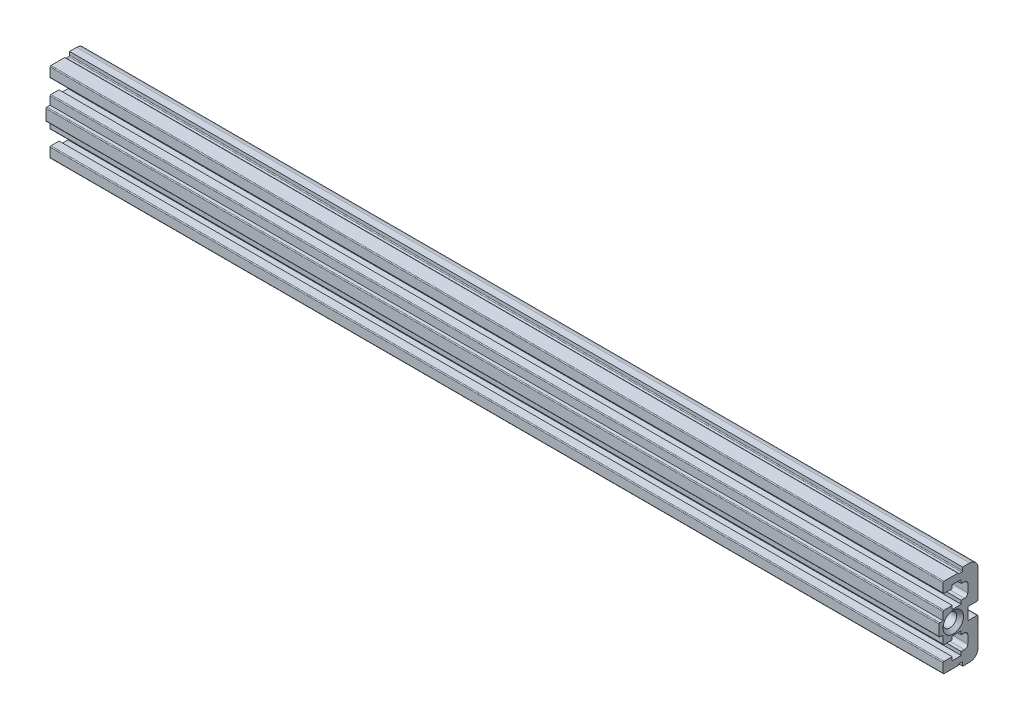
ISO-10303-21;
HEADER;
FILE_DESCRIPTION(('STEP AP214'),'2;1');
FILE_NAME('part.step','',(''),(''),'','','');
FILE_SCHEMA(('AUTOMOTIVE_DESIGN { 1 0 10303 214 1 1 1 1 }'));
ENDSEC;
DATA;
#1=APPLICATION_CONTEXT('core data for automotive mechanical design processes');
#2=APPLICATION_PROTOCOL_DEFINITION('international standard','automotive_design',2000,#1);
#3=PRODUCT_CONTEXT('',#1,'mechanical');
#4=PRODUCT('Part','Part','',(#3));
#5=PRODUCT_RELATED_PRODUCT_CATEGORY('part','',(#4));
#6=PRODUCT_DEFINITION_FORMATION('','',#4);
#7=PRODUCT_DEFINITION_CONTEXT('part definition',#1,'design');
#8=PRODUCT_DEFINITION('design','',#6,#7);
#9=PRODUCT_DEFINITION_SHAPE('','',#8);
#10=(LENGTH_UNIT() NAMED_UNIT(*) SI_UNIT(.MILLI.,.METRE.));
#11=(NAMED_UNIT(*) PLANE_ANGLE_UNIT() SI_UNIT($,.RADIAN.));
#12=(NAMED_UNIT(*) SI_UNIT($,.STERADIAN.) SOLID_ANGLE_UNIT());
#13=UNCERTAINTY_MEASURE_WITH_UNIT(LENGTH_MEASURE(1.E-05),#10,'distance_accuracy_value','');
#14=(GEOMETRIC_REPRESENTATION_CONTEXT(3) GLOBAL_UNCERTAINTY_ASSIGNED_CONTEXT((#13)) GLOBAL_UNIT_ASSIGNED_CONTEXT((#10,
#11,#12)) REPRESENTATION_CONTEXT('',''));
#15=CARTESIAN_POINT('',(0.,0.,0.));
#16=DIRECTION('',(0.,0.,1.));
#17=DIRECTION('',(1.,0.,0.));
#18=AXIS2_PLACEMENT_3D('',#15,#16,#17);
#19=CARTESIAN_POINT('',(215.9,-9.9,14.8));
#20=DIRECTION('',(1.,0.,0.));
#21=DIRECTION('',(0.,0.,-1.));
#22=AXIS2_PLACEMENT_3D('',#19,#20,#21);
#23=CYLINDRICAL_SURFACE('',#22,1.25);
#24=CARTESIAN_POINT('',(200.659655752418,-9.9,14.8));
#25=DIRECTION('',(1.,0.,0.));
#26=DIRECTION('',(0.,0.,-1.));
#27=AXIS2_PLACEMENT_3D('',#24,#25,#26);
#28=CIRCLE('',#27,1.25000000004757);
#29=CARTESIAN_POINT('',(200.659655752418,-9.9,13.5499999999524));
#30=VERTEX_POINT('',#29);
#31=EDGE_CURVE('E568',#30,#30,#28,.T.);
#32=ORIENTED_EDGE('',*,*,#31,.T.);
#33=EDGE_LOOP('',(#32));
#34=FACE_BOUND('',#33,.T.);
#35=CARTESIAN_POINT('',(12.48,-9.9,14.8));
#36=DIRECTION('',(-1.,0.,0.));
#37=DIRECTION('',(0.,0.,1.));
#38=AXIS2_PLACEMENT_3D('',#35,#36,#37);
#39=CIRCLE('',#38,1.25);
#40=CARTESIAN_POINT('',(12.48,-9.9,16.05));
#41=VERTEX_POINT('',#40);
#42=EDGE_CURVE('E637',#41,#41,#39,.F.);
#43=ORIENTED_EDGE('',*,*,#42,.F.);
#44=EDGE_LOOP('',(#43));
#45=FACE_BOUND('',#44,.T.);
#46=ADVANCED_FACE('F50',(#34,#45),#23,.F.);
#47=CARTESIAN_POINT('',(-215.9,-19.4,12.5));
#48=DIRECTION('',(0.,1.,0.));
#49=DIRECTION('',(0.,0.,1.));
#50=AXIS2_PLACEMENT_3D('',#47,#48,#49);
#51=PLANE('',#50);
#52=DIRECTION('',(1.,0.,0.));
#53=VECTOR('',#52,1.);
#54=CARTESIAN_POINT('',(-215.9,-19.4,13.3));
#55=LINE('',#54,#53);
#56=CARTESIAN_POINT('',(215.9,-19.4,13.3));
#57=VERTEX_POINT('',#56);
#58=CARTESIAN_POINT('',(-2.53999999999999,-19.4,13.3));
#59=VERTEX_POINT('',#58);
#60=EDGE_CURVE('E390',#57,#59,#55,.F.);
#61=ORIENTED_EDGE('',*,*,#60,.T.);
#62=DIRECTION('',(0.,0.,-1.));
#63=VECTOR('',#62,1.);
#64=CARTESIAN_POINT('',(-2.53999999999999,-19.4,12.5));
#65=LINE('',#64,#63);
#66=CARTESIAN_POINT('',(-2.53999999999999,-19.4,12.7));
#67=VERTEX_POINT('',#66);
#68=EDGE_CURVE('E778',#59,#67,#65,.T.);
#69=ORIENTED_EDGE('',*,*,#68,.T.);
#70=DIRECTION('',(1.,0.,0.));
#71=VECTOR('',#70,1.);
#72=CARTESIAN_POINT('',(-215.9,-19.4,12.7));
#73=LINE('',#72,#71);
#74=CARTESIAN_POINT('',(215.9,-19.4,12.7));
#75=VERTEX_POINT('',#74);
#76=EDGE_CURVE('E386',#67,#75,#73,.T.);
#77=ORIENTED_EDGE('',*,*,#76,.T.);
#78=DIRECTION('',(0.,0.,1.));
#79=VECTOR('',#78,1.);
#80=CARTESIAN_POINT('',(215.9,-19.4,12.5));
#81=LINE('',#80,#79);
#82=EDGE_CURVE('E215',#57,#75,#81,.F.);
#83=ORIENTED_EDGE('',*,*,#82,.F.);
#84=EDGE_LOOP('',(#61,#69,#77,#83));
#85=FACE_BOUND('',#84,.T.);
#86=ADVANCED_FACE('F946',(#85),#51,.F.);
#87=CARTESIAN_POINT('',(-215.9,-0.400000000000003,12.5));
#88=DIRECTION('',(0.,-1.,0.));
#89=DIRECTION('',(0.,0.,-1.));
#90=AXIS2_PLACEMENT_3D('',#87,#88,#89);
#91=PLANE('',#90);
#92=DIRECTION('',(1.,0.,0.));
#93=VECTOR('',#92,1.);
#94=CARTESIAN_POINT('',(-215.9,-0.400000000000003,12.7));
#95=LINE('',#94,#93);
#96=CARTESIAN_POINT('',(215.9,-0.400000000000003,12.7));
#97=VERTEX_POINT('',#96);
#98=CARTESIAN_POINT('',(-2.53999999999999,-0.400000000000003,12.7));
#99=VERTEX_POINT('',#98);
#100=EDGE_CURVE('E382',#97,#99,#95,.F.);
#101=ORIENTED_EDGE('',*,*,#100,.T.);
#102=DIRECTION('',(0.,0.,1.));
#103=VECTOR('',#102,1.);
#104=CARTESIAN_POINT('',(-2.53999999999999,-0.400000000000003,12.5));
#105=LINE('',#104,#103);
#106=CARTESIAN_POINT('',(-2.53999999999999,-0.400000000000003,13.3));
#107=VERTEX_POINT('',#106);
#108=EDGE_CURVE('E1082',#99,#107,#105,.T.);
#109=ORIENTED_EDGE('',*,*,#108,.T.);
#110=DIRECTION('',(1.,0.,0.));
#111=VECTOR('',#110,1.);
#112=CARTESIAN_POINT('',(-215.9,-0.400000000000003,13.3));
#113=LINE('',#112,#111);
#114=CARTESIAN_POINT('',(215.9,-0.400000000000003,13.3));
#115=VERTEX_POINT('',#114);
#116=EDGE_CURVE('E378',#107,#115,#113,.T.);
#117=ORIENTED_EDGE('',*,*,#116,.T.);
#118=DIRECTION('',(0.,0.,-1.));
#119=VECTOR('',#118,1.);
#120=CARTESIAN_POINT('',(215.9,-0.400000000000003,12.5));
#121=LINE('',#120,#119);
#122=EDGE_CURVE('E652',#97,#115,#121,.F.);
#123=ORIENTED_EDGE('',*,*,#122,.F.);
#124=EDGE_LOOP('',(#101,#109,#117,#123));
#125=FACE_BOUND('',#124,.T.);
#126=ADVANCED_FACE('F1125',(#125),#91,.F.);
#127=CARTESIAN_POINT('',(-215.9,-19.6,13.3));
#128=DIRECTION('',(1.,0.,0.));
#129=DIRECTION('',(0.,0.,-1.));
#130=AXIS2_PLACEMENT_3D('',#127,#128,#129);
#131=CYLINDRICAL_SURFACE('',#130,0.2);
#132=DIRECTION('',(1.,0.,0.));
#133=VECTOR('',#132,1.);
#134=CARTESIAN_POINT('',(-215.9,-19.55,13.4936491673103));
#135=LINE('',#134,#133);
#136=CARTESIAN_POINT('',(-2.53999999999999,-19.55,13.4936491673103));
#137=VERTEX_POINT('',#136);
#138=CARTESIAN_POINT('',(215.9,-19.55,13.4936491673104));
#139=VERTEX_POINT('',#138);
#140=EDGE_CURVE('E373',#137,#139,#135,.T.);
#141=ORIENTED_EDGE('',*,*,#140,.F.);
#142=CARTESIAN_POINT('',(-2.53999999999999,-19.6,13.3));
#143=DIRECTION('',(1.,0.,0.));
#144=DIRECTION('',(0.,0.,-1.));
#145=AXIS2_PLACEMENT_3D('',#142,#143,#144);
#146=CIRCLE('',#145,0.2);
#147=EDGE_CURVE('E783',#137,#59,#146,.F.);
#148=ORIENTED_EDGE('',*,*,#147,.T.);
#149=ORIENTED_EDGE('',*,*,#60,.F.);
#150=CARTESIAN_POINT('',(215.9,-19.6,13.3));
#151=DIRECTION('',(1.,0.,0.));
#152=DIRECTION('',(0.,0.,-1.));
#153=AXIS2_PLACEMENT_3D('',#150,#151,#152);
#154=CIRCLE('',#153,0.2);
#155=EDGE_CURVE('E387',#139,#57,#154,.F.);
#156=ORIENTED_EDGE('',*,*,#155,.F.);
#157=EDGE_LOOP('',(#141,#148,#149,#156));
#158=FACE_BOUND('',#157,.T.);
#159=ADVANCED_FACE('F940',(#158),#131,.F.);
#160=CARTESIAN_POINT('',(-215.9,-19.6,12.7));
#161=DIRECTION('',(1.,0.,0.));
#162=DIRECTION('',(0.,0.,-1.));
#163=AXIS2_PLACEMENT_3D('',#160,#161,#162);
#164=CYLINDRICAL_SURFACE('',#163,0.2);
#165=ORIENTED_EDGE('',*,*,#76,.F.);
#166=CARTESIAN_POINT('',(-2.53999999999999,-19.6,12.7));
#167=DIRECTION('',(1.,0.,0.));
#168=DIRECTION('',(0.,0.,-1.));
#169=AXIS2_PLACEMENT_3D('',#166,#167,#168);
#170=CIRCLE('',#169,0.2);
#171=CARTESIAN_POINT('',(-2.53999999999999,-19.6,12.5));
#172=VERTEX_POINT('',#171);
#173=EDGE_CURVE('E789',#67,#172,#170,.F.);
#174=ORIENTED_EDGE('',*,*,#173,.T.);
#175=DIRECTION('',(-1.,0.,0.));
#176=VECTOR('',#175,1.);
#177=CARTESIAN_POINT('',(-215.9,-19.6,12.5));
#178=LINE('',#177,#176);
#179=CARTESIAN_POINT('',(215.9,-19.6,12.5));
#180=VERTEX_POINT('',#179);
#181=EDGE_CURVE('E372',#172,#180,#178,.F.);
#182=ORIENTED_EDGE('',*,*,#181,.T.);
#183=CARTESIAN_POINT('',(215.9,-19.6,12.7));
#184=DIRECTION('',(1.,0.,0.));
#185=DIRECTION('',(0.,0.,-1.));
#186=AXIS2_PLACEMENT_3D('',#183,#184,#185);
#187=CIRCLE('',#186,0.2);
#188=EDGE_CURVE('E383',#75,#180,#187,.F.);
#189=ORIENTED_EDGE('',*,*,#188,.F.);
#190=EDGE_LOOP('',(#165,#174,#182,#189));
#191=FACE_BOUND('',#190,.T.);
#192=ADVANCED_FACE('F952',(#191),#164,.F.);
#193=CARTESIAN_POINT('',(-215.9,-0.200000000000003,12.7));
#194=DIRECTION('',(1.,0.,0.));
#195=DIRECTION('',(0.,0.,-1.));
#196=AXIS2_PLACEMENT_3D('',#193,#194,#195);
#197=CYLINDRICAL_SURFACE('',#196,0.2);
#198=DIRECTION('',(1.,0.,0.));
#199=VECTOR('',#198,1.);
#200=CARTESIAN_POINT('',(-215.9,-0.200000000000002,12.5));
#201=LINE('',#200,#199);
#202=CARTESIAN_POINT('',(215.9,-0.200000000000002,12.5));
#203=VERTEX_POINT('',#202);
#204=CARTESIAN_POINT('',(-2.53999999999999,-0.200000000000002,12.5));
#205=VERTEX_POINT('',#204);
#206=EDGE_CURVE('E365',#203,#205,#201,.F.);
#207=ORIENTED_EDGE('',*,*,#206,.T.);
#208=CARTESIAN_POINT('',(-2.53999999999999,-0.200000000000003,12.7));
#209=DIRECTION('',(1.,0.,0.));
#210=DIRECTION('',(0.,0.,-1.));
#211=AXIS2_PLACEMENT_3D('',#208,#209,#210);
#212=CIRCLE('',#211,0.2);
#213=EDGE_CURVE('E1085',#205,#99,#212,.F.);
#214=ORIENTED_EDGE('',*,*,#213,.T.);
#215=ORIENTED_EDGE('',*,*,#100,.F.);
#216=CARTESIAN_POINT('',(215.9,-0.200000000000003,12.7));
#217=DIRECTION('',(1.,0.,0.));
#218=DIRECTION('',(0.,0.,-1.));
#219=AXIS2_PLACEMENT_3D('',#216,#217,#218);
#220=CIRCLE('',#219,0.2);
#221=EDGE_CURVE('E379',#203,#97,#220,.F.);
#222=ORIENTED_EDGE('',*,*,#221,.F.);
#223=EDGE_LOOP('',(#207,#214,#215,#222));
#224=FACE_BOUND('',#223,.T.);
#225=ADVANCED_FACE('F1336',(#224),#197,.F.);
#226=CARTESIAN_POINT('',(-215.9,-0.200000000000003,13.3));
#227=DIRECTION('',(1.,0.,0.));
#228=DIRECTION('',(0.,0.,-1.));
#229=AXIS2_PLACEMENT_3D('',#226,#227,#228);
#230=CYLINDRICAL_SURFACE('',#229,0.2);
#231=ORIENTED_EDGE('',*,*,#116,.F.);
#232=CARTESIAN_POINT('',(-2.53999999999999,-0.200000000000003,13.3));
#233=DIRECTION('',(1.,0.,0.));
#234=DIRECTION('',(0.,0.,-1.));
#235=AXIS2_PLACEMENT_3D('',#232,#233,#234);
#236=CIRCLE('',#235,0.2);
#237=CARTESIAN_POINT('',(-2.53999999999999,-0.250000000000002,13.4936491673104));
#238=VERTEX_POINT('',#237);
#239=EDGE_CURVE('E1079',#107,#238,#236,.F.);
#240=ORIENTED_EDGE('',*,*,#239,.T.);
#241=DIRECTION('',(1.,0.,0.));
#242=VECTOR('',#241,1.);
#243=CARTESIAN_POINT('',(-215.9,-0.249999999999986,13.4936491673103));
#244=LINE('',#243,#242);
#245=CARTESIAN_POINT('',(215.9,-0.249999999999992,13.4936491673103));
#246=VERTEX_POINT('',#245);
#247=EDGE_CURVE('E362',#246,#238,#244,.F.);
#248=ORIENTED_EDGE('',*,*,#247,.F.);
#249=CARTESIAN_POINT('',(215.9,-0.200000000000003,13.3));
#250=DIRECTION('',(1.,0.,0.));
#251=DIRECTION('',(0.,0.,-1.));
#252=AXIS2_PLACEMENT_3D('',#249,#250,#251);
#253=CIRCLE('',#252,0.2);
#254=EDGE_CURVE('E374',#115,#246,#253,.F.);
#255=ORIENTED_EDGE('',*,*,#254,.F.);
#256=EDGE_LOOP('',(#231,#240,#248,#255));
#257=FACE_BOUND('',#256,.T.);
#258=ADVANCED_FACE('F1332',(#257),#230,.F.);
#259=CARTESIAN_POINT('',(-215.9,-2.7,12.85));
#260=DIRECTION('',(0.,1.,0.));
#261=DIRECTION('',(0.,0.,1.));
#262=AXIS2_PLACEMENT_3D('',#259,#260,#261);
#263=PLANE('',#262);
#264=DIRECTION('',(1.,0.,0.));
#265=VECTOR('',#264,1.);
#266=CARTESIAN_POINT('',(-215.9,-2.7,12.85));
#267=LINE('',#266,#265);
#268=CARTESIAN_POINT('',(215.9,-2.7,12.85));
#269=VERTEX_POINT('',#268);
#270=CARTESIAN_POINT('',(-2.53999999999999,-2.7,12.85));
#271=VERTEX_POINT('',#270);
#272=EDGE_CURVE('E359',#269,#271,#267,.F.);
#273=ORIENTED_EDGE('',*,*,#272,.T.);
#274=DIRECTION('',(0.,0.,-1.));
#275=VECTOR('',#274,1.);
#276=CARTESIAN_POINT('',(-2.53999999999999,-2.7,12.85));
#277=LINE('',#276,#275);
#278=CARTESIAN_POINT('',(-2.53999999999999,-2.7,12.05));
#279=VERTEX_POINT('',#278);
#280=EDGE_CURVE('E1049',#271,#279,#277,.T.);
#281=ORIENTED_EDGE('',*,*,#280,.T.);
#282=DIRECTION('',(1.,0.,0.));
#283=VECTOR('',#282,1.);
#284=CARTESIAN_POINT('',(-215.9,-2.7,12.05));
#285=LINE('',#284,#283);
#286=CARTESIAN_POINT('',(215.9,-2.7,12.05));
#287=VERTEX_POINT('',#286);
#288=EDGE_CURVE('E356',#279,#287,#285,.T.);
#289=ORIENTED_EDGE('',*,*,#288,.T.);
#290=DIRECTION('',(0.,0.,1.));
#291=VECTOR('',#290,1.);
#292=CARTESIAN_POINT('',(215.9,-2.7,12.85));
#293=LINE('',#292,#291);
#294=EDGE_CURVE('E377',#269,#287,#293,.F.);
#295=ORIENTED_EDGE('',*,*,#294,.F.);
#296=EDGE_LOOP('',(#273,#281,#289,#295));
#297=FACE_BOUND('',#296,.T.);
#298=ADVANCED_FACE('F1329',(#297),#263,.F.);
#299=CARTESIAN_POINT('',(-215.9,-6.25,12.85));
#300=DIRECTION('',(0.,-1.,0.));
#301=DIRECTION('',(0.,0.,-1.));
#302=AXIS2_PLACEMENT_3D('',#299,#300,#301);
#303=PLANE('',#302);
#304=DIRECTION('',(1.,0.,0.));
#305=VECTOR('',#304,1.);
#306=CARTESIAN_POINT('',(-215.9,-6.25,12.05));
#307=LINE('',#306,#305);
#308=CARTESIAN_POINT('',(215.9,-6.25,12.05));
#309=VERTEX_POINT('',#308);
#310=CARTESIAN_POINT('',(-2.53999999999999,-6.25,12.05));
#311=VERTEX_POINT('',#310);
#312=EDGE_CURVE('E352',#309,#311,#307,.F.);
#313=ORIENTED_EDGE('',*,*,#312,.T.);
#314=DIRECTION('',(0.,0.,1.));
#315=VECTOR('',#314,1.);
#316=CARTESIAN_POINT('',(-2.53999999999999,-6.25,12.85));
#317=LINE('',#316,#315);
#318=CARTESIAN_POINT('',(-2.53999999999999,-6.25,12.85));
#319=VERTEX_POINT('',#318);
#320=EDGE_CURVE('E906',#311,#319,#317,.T.);
#321=ORIENTED_EDGE('',*,*,#320,.T.);
#322=DIRECTION('',(1.,0.,0.));
#323=VECTOR('',#322,1.);
#324=CARTESIAN_POINT('',(-215.9,-6.25,12.85));
#325=LINE('',#324,#323);
#326=CARTESIAN_POINT('',(215.9,-6.25,12.85));
#327=VERTEX_POINT('',#326);
#328=EDGE_CURVE('E602',#319,#327,#325,.T.);
#329=ORIENTED_EDGE('',*,*,#328,.T.);
#330=DIRECTION('',(0.,0.,-1.));
#331=VECTOR('',#330,1.);
#332=CARTESIAN_POINT('',(215.9,-6.25,12.85));
#333=LINE('',#332,#331);
#334=EDGE_CURVE('E575',#309,#327,#333,.F.);
#335=ORIENTED_EDGE('',*,*,#334,.F.);
#336=EDGE_LOOP('',(#313,#321,#329,#335));
#337=FACE_BOUND('',#336,.T.);
#338=ADVANCED_FACE('F1038',(#337),#303,.F.);
#339=CARTESIAN_POINT('',(-215.9,-13.55,12.85));
#340=DIRECTION('',(0.,1.,0.));
#341=DIRECTION('',(0.,0.,1.));
#342=AXIS2_PLACEMENT_3D('',#339,#340,#341);
#343=PLANE('',#342);
#344=DIRECTION('',(1.,0.,0.));
#345=VECTOR('',#344,1.);
#346=CARTESIAN_POINT('',(-215.9,-13.55,12.85));
#347=LINE('',#346,#345);
#348=CARTESIAN_POINT('',(215.9,-13.55,12.85));
#349=VERTEX_POINT('',#348);
#350=CARTESIAN_POINT('',(-2.53999999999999,-13.55,12.85));
#351=VERTEX_POINT('',#350);
#352=EDGE_CURVE('E338',#349,#351,#347,.F.);
#353=ORIENTED_EDGE('',*,*,#352,.T.);
#354=DIRECTION('',(0.,0.,-1.));
#355=VECTOR('',#354,1.);
#356=CARTESIAN_POINT('',(-2.53999999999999,-13.55,12.85));
#357=LINE('',#356,#355);
#358=CARTESIAN_POINT('',(-2.53999999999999,-13.55,12.05));
#359=VERTEX_POINT('',#358);
#360=EDGE_CURVE('E807',#351,#359,#357,.T.);
#361=ORIENTED_EDGE('',*,*,#360,.T.);
#362=DIRECTION('',(1.,0.,0.));
#363=VECTOR('',#362,1.);
#364=CARTESIAN_POINT('',(-215.9,-13.55,12.05));
#365=LINE('',#364,#363);
#366=CARTESIAN_POINT('',(215.9,-13.55,12.05));
#367=VERTEX_POINT('',#366);
#368=EDGE_CURVE('E335',#359,#367,#365,.T.);
#369=ORIENTED_EDGE('',*,*,#368,.T.);
#370=DIRECTION('',(0.,0.,1.));
#371=VECTOR('',#370,1.);
#372=CARTESIAN_POINT('',(215.9,-13.55,12.85));
#373=LINE('',#372,#371);
#374=EDGE_CURVE('E569',#349,#367,#373,.F.);
#375=ORIENTED_EDGE('',*,*,#374,.F.);
#376=EDGE_LOOP('',(#353,#361,#369,#375));
#377=FACE_BOUND('',#376,.T.);
#378=ADVANCED_FACE('F1322',(#377),#343,.F.);
#379=CARTESIAN_POINT('',(-215.9,-17.1,12.85));
#380=DIRECTION('',(0.,-1.,0.));
#381=DIRECTION('',(0.,0.,-1.));
#382=AXIS2_PLACEMENT_3D('',#379,#380,#381);
#383=PLANE('',#382);
#384=DIRECTION('',(1.,0.,0.));
#385=VECTOR('',#384,1.);
#386=CARTESIAN_POINT('',(-215.9,-17.1,12.05));
#387=LINE('',#386,#385);
#388=CARTESIAN_POINT('',(215.9,-17.1,12.05));
#389=VERTEX_POINT('',#388);
#390=CARTESIAN_POINT('',(-2.53999999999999,-17.1,12.05));
#391=VERTEX_POINT('',#390);
#392=EDGE_CURVE('E331',#389,#391,#387,.F.);
#393=ORIENTED_EDGE('',*,*,#392,.T.);
#394=DIRECTION('',(0.,0.,1.));
#395=VECTOR('',#394,1.);
#396=CARTESIAN_POINT('',(-2.53999999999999,-17.1,12.85));
#397=LINE('',#396,#395);
#398=CARTESIAN_POINT('',(-2.53999999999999,-17.1,12.85));
#399=VERTEX_POINT('',#398);
#400=EDGE_CURVE('E780',#391,#399,#397,.T.);
#401=ORIENTED_EDGE('',*,*,#400,.T.);
#402=DIRECTION('',(1.,0.,0.));
#403=VECTOR('',#402,1.);
#404=CARTESIAN_POINT('',(-215.9,-17.1,12.85));
#405=LINE('',#404,#403);
#406=CARTESIAN_POINT('',(215.9,-17.1,12.85));
#407=VERTEX_POINT('',#406);
#408=EDGE_CURVE('E564',#399,#407,#405,.T.);
#409=ORIENTED_EDGE('',*,*,#408,.T.);
#410=DIRECTION('',(0.,0.,-1.));
#411=VECTOR('',#410,1.);
#412=CARTESIAN_POINT('',(215.9,-17.1,12.85));
#413=LINE('',#412,#411);
#414=EDGE_CURVE('E565',#389,#407,#413,.F.);
#415=ORIENTED_EDGE('',*,*,#414,.F.);
#416=EDGE_LOOP('',(#393,#401,#409,#415));
#417=FACE_BOUND('',#416,.T.);
#418=ADVANCED_FACE('F1318',(#417),#383,.F.);
#419=CARTESIAN_POINT('',(200.89999999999,-9.9,14.8));
#420=DIRECTION('',(1.,0.,0.));
#421=DIRECTION('',(0.,0.,-1.));
#422=AXIS2_PLACEMENT_3D('',#419,#420,#421);
#423=CONICAL_SURFACE('',#422,1.64999999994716,1.02974425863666);
#424=CARTESIAN_POINT('',(200.9,-9.9,14.8));
#425=DIRECTION('',(-1.,0.,0.));
#426=DIRECTION('',(0.,0.,1.));
#427=AXIS2_PLACEMENT_3D('',#424,#425,#426);
#428=CIRCLE('',#427,1.65);
#429=CARTESIAN_POINT('',(200.9,-9.9,16.45));
#430=VERTEX_POINT('',#429);
#431=EDGE_CURVE('E324',#430,#430,#428,.F.);
#432=ORIENTED_EDGE('',*,*,#431,.T.);
#433=EDGE_LOOP('',(#432));
#434=FACE_BOUND('',#433,.T.);
#435=ORIENTED_EDGE('',*,*,#31,.F.);
#436=EDGE_LOOP('',(#435));
#437=FACE_BOUND('',#436,.T.);
#438=ADVANCED_FACE('F1314',(#434,#437),#423,.F.);
#439=CARTESIAN_POINT('',(-215.9,-19.5,13.6872983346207));
#440=DIRECTION('',(1.,0.,0.));
#441=DIRECTION('',(0.,0.,-1.));
#442=AXIS2_PLACEMENT_3D('',#439,#440,#441);
#443=CYLINDRICAL_SURFACE('',#442,0.2);
#444=CARTESIAN_POINT('',(-2.53999999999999,-19.5,13.6872983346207));
#445=DIRECTION('',(1.,0.,0.));
#446=DIRECTION('',(0.,0.,-1.));
#447=AXIS2_PLACEMENT_3D('',#444,#445,#446);
#448=CIRCLE('',#447,0.2);
#449=CARTESIAN_POINT('',(-2.53999999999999,-19.7,13.6872983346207));
#450=VERTEX_POINT('',#449);
#451=EDGE_CURVE('E933',#137,#450,#448,.F.);
#452=ORIENTED_EDGE('',*,*,#451,.F.);
#453=ORIENTED_EDGE('',*,*,#140,.T.);
#454=CARTESIAN_POINT('',(215.9,-19.5,13.6872983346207));
#455=DIRECTION('',(1.,0.,0.));
#456=DIRECTION('',(0.,0.,-1.));
#457=AXIS2_PLACEMENT_3D('',#454,#455,#456);
#458=CIRCLE('',#457,0.2);
#459=CARTESIAN_POINT('',(215.9,-19.7,13.6872983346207));
#460=VERTEX_POINT('',#459);
#461=EDGE_CURVE('E370',#139,#460,#458,.F.);
#462=ORIENTED_EDGE('',*,*,#461,.T.);
#463=DIRECTION('',(1.,0.,0.));
#464=VECTOR('',#463,1.);
#465=CARTESIAN_POINT('',(-215.9,-19.7,13.6872983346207));
#466=LINE('',#465,#464);
#467=EDGE_CURVE('E505',#460,#450,#466,.F.);
#468=ORIENTED_EDGE('',*,*,#467,.T.);
#469=EDGE_LOOP('',(#452,#453,#462,#468));
#470=FACE_BOUND('',#469,.T.);
#471=ADVANCED_FACE('F1311',(#470),#443,.T.);
#472=CARTESIAN_POINT('',(-215.9,-19.7,12.5));
#473=DIRECTION('',(0.,0.,-1.));
#474=DIRECTION('',(-1.,0.,0.));
#475=AXIS2_PLACEMENT_3D('',#472,#473,#474);
#476=PLANE('',#475);
#477=ORIENTED_EDGE('',*,*,#181,.F.);
#478=DIRECTION('',(0.,-1.,0.));
#479=VECTOR('',#478,1.);
#480=CARTESIAN_POINT('',(-2.53999999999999,-19.7,12.5));
#481=LINE('',#480,#479);
#482=CARTESIAN_POINT('',(-2.53999999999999,-20.4,12.5));
#483=VERTEX_POINT('',#482);
#484=EDGE_CURVE('E795',#172,#483,#481,.T.);
#485=ORIENTED_EDGE('',*,*,#484,.T.);
#486=DIRECTION('',(1.,0.,0.));
#487=VECTOR('',#486,1.);
#488=CARTESIAN_POINT('',(215.9,-20.4,12.5));
#489=LINE('',#488,#487);
#490=CARTESIAN_POINT('',(215.9,-20.4,12.5));
#491=VERTEX_POINT('',#490);
#492=EDGE_CURVE('E487',#483,#491,#489,.T.);
#493=ORIENTED_EDGE('',*,*,#492,.T.);
#494=DIRECTION('',(0.,1.,0.));
#495=VECTOR('',#494,1.);
#496=CARTESIAN_POINT('',(215.9,-19.7,12.5));
#497=LINE('',#496,#495);
#498=EDGE_CURVE('E369',#180,#491,#497,.F.);
#499=ORIENTED_EDGE('',*,*,#498,.F.);
#500=EDGE_LOOP('',(#477,#485,#493,#499));
#501=FACE_BOUND('',#500,.T.);
#502=ADVANCED_FACE('F958',(#501),#476,.F.);
#503=CARTESIAN_POINT('',(215.9,-11.6,8.95));
#504=DIRECTION('',(1.,0.,0.));
#505=DIRECTION('',(0.,0.,-1.));
#506=AXIS2_PLACEMENT_3D('',#503,#504,#505);
#507=CYLINDRICAL_SURFACE('',#506,0.2);
#508=CARTESIAN_POINT('',(-2.53999999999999,-11.6,8.95));
#509=DIRECTION('',(1.,0.,0.));
#510=DIRECTION('',(0.,0.,-1.));
#511=AXIS2_PLACEMENT_3D('',#508,#509,#510);
#512=CIRCLE('',#511,0.2);
#513=CARTESIAN_POINT('',(-2.53999999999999,-11.4,8.95));
#514=VERTEX_POINT('',#513);
#515=CARTESIAN_POINT('',(-2.53999999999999,-11.6,8.75));
#516=VERTEX_POINT('',#515);
#517=EDGE_CURVE('E1095',#514,#516,#512,.F.);
#518=ORIENTED_EDGE('',*,*,#517,.F.);
#519=DIRECTION('',(1.,0.,0.));
#520=VECTOR('',#519,1.);
#521=CARTESIAN_POINT('',(215.9,-11.4,8.95));
#522=LINE('',#521,#520);
#523=CARTESIAN_POINT('',(215.9,-11.4,8.95));
#524=VERTEX_POINT('',#523);
#525=EDGE_CURVE('E486',#514,#524,#522,.T.);
#526=ORIENTED_EDGE('',*,*,#525,.T.);
#527=CARTESIAN_POINT('',(215.9,-11.6,8.95));
#528=DIRECTION('',(1.,0.,0.));
#529=DIRECTION('',(0.,0.,-1.));
#530=AXIS2_PLACEMENT_3D('',#527,#528,#529);
#531=CIRCLE('',#530,0.2);
#532=CARTESIAN_POINT('',(215.9,-11.6,8.75));
#533=VERTEX_POINT('',#532);
#534=EDGE_CURVE('E366',#524,#533,#531,.F.);
#535=ORIENTED_EDGE('',*,*,#534,.T.);
#536=DIRECTION('',(1.,0.,0.));
#537=VECTOR('',#536,1.);
#538=CARTESIAN_POINT('',(215.9,-11.6,8.75));
#539=LINE('',#538,#537);
#540=EDGE_CURVE('E494',#533,#516,#539,.F.);
#541=ORIENTED_EDGE('',*,*,#540,.T.);
#542=EDGE_LOOP('',(#518,#526,#535,#541));
#543=FACE_BOUND('',#542,.T.);
#544=ADVANCED_FACE('F1304',(#543),#507,.T.);
#545=CARTESIAN_POINT('',(-215.9,-0.100000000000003,12.5));
#546=DIRECTION('',(0.,0.,-1.));
#547=DIRECTION('',(0.,1.,0.));
#548=AXIS2_PLACEMENT_3D('',#545,#546,#547);
#549=PLANE('',#548);
#550=DIRECTION('',(1.,0.,0.));
#551=VECTOR('',#550,1.);
#552=CARTESIAN_POINT('',(215.9,0.599999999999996,12.5));
#553=LINE('',#552,#551);
#554=CARTESIAN_POINT('',(215.9,0.599999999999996,12.5));
#555=VERTEX_POINT('',#554);
#556=CARTESIAN_POINT('',(-2.53999999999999,0.599999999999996,12.5));
#557=VERTEX_POINT('',#556);
#558=EDGE_CURVE('E469',#555,#557,#553,.F.);
#559=ORIENTED_EDGE('',*,*,#558,.T.);
#560=DIRECTION('',(0.,-1.,0.));
#561=VECTOR('',#560,1.);
#562=CARTESIAN_POINT('',(-2.53999999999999,-0.100000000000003,12.5));
#563=LINE('',#562,#561);
#564=EDGE_CURVE('E1088',#557,#205,#563,.T.);
#565=ORIENTED_EDGE('',*,*,#564,.T.);
#566=ORIENTED_EDGE('',*,*,#206,.F.);
#567=DIRECTION('',(0.,1.,0.));
#568=VECTOR('',#567,1.);
#569=CARTESIAN_POINT('',(215.9,-0.100000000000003,12.5));
#570=LINE('',#569,#568);
#571=EDGE_CURVE('E368',#555,#203,#570,.F.);
#572=ORIENTED_EDGE('',*,*,#571,.F.);
#573=EDGE_LOOP('',(#559,#565,#566,#572));
#574=FACE_BOUND('',#573,.T.);
#575=ADVANCED_FACE('F1300',(#574),#549,.F.);
#576=CARTESIAN_POINT('',(-215.9,-0.300000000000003,13.6872983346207));
#577=DIRECTION('',(1.,0.,0.));
#578=DIRECTION('',(0.,0.,-1.));
#579=AXIS2_PLACEMENT_3D('',#576,#577,#578);
#580=CYLINDRICAL_SURFACE('',#579,0.2);
#581=CARTESIAN_POINT('',(-2.53999999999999,-0.300000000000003,13.6872983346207));
#582=DIRECTION('',(1.,0.,0.));
#583=DIRECTION('',(0.,0.,-1.));
#584=AXIS2_PLACEMENT_3D('',#581,#582,#583);
#585=CIRCLE('',#584,0.2);
#586=CARTESIAN_POINT('',(-2.53999999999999,-0.100000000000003,13.6872983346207));
#587=VERTEX_POINT('',#586);
#588=EDGE_CURVE('E1076',#587,#238,#585,.F.);
#589=ORIENTED_EDGE('',*,*,#588,.F.);
#590=DIRECTION('',(1.,0.,0.));
#591=VECTOR('',#590,1.);
#592=CARTESIAN_POINT('',(-215.9,-0.100000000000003,13.6872983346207));
#593=LINE('',#592,#591);
#594=CARTESIAN_POINT('',(215.9,-0.100000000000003,13.6872983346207));
#595=VERTEX_POINT('',#594);
#596=EDGE_CURVE('E467',#587,#595,#593,.T.);
#597=ORIENTED_EDGE('',*,*,#596,.T.);
#598=CARTESIAN_POINT('',(215.9,-0.300000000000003,13.6872983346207));
#599=DIRECTION('',(1.,0.,0.));
#600=DIRECTION('',(0.,0.,-1.));
#601=AXIS2_PLACEMENT_3D('',#598,#599,#600);
#602=CIRCLE('',#601,0.2);
#603=EDGE_CURVE('E363',#595,#246,#602,.F.);
#604=ORIENTED_EDGE('',*,*,#603,.T.);
#605=ORIENTED_EDGE('',*,*,#247,.T.);
#606=EDGE_LOOP('',(#589,#597,#604,#605));
#607=FACE_BOUND('',#606,.T.);
#608=ADVANCED_FACE('F1296',(#607),#580,.T.);
#609=CARTESIAN_POINT('',(-215.9,-0.300000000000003,17.05));
#610=DIRECTION('',(-1.,0.,0.));
#611=DIRECTION('',(0.,0.,1.));
#612=AXIS2_PLACEMENT_3D('',#609,#610,#611);
#613=CYLINDRICAL_SURFACE('',#612,0.199999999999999);
#614=CARTESIAN_POINT('',(-2.53999999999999,-0.300000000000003,17.05));
#615=DIRECTION('',(1.,0.,0.));
#616=DIRECTION('',(0.,0.,-1.));
#617=AXIS2_PLACEMENT_3D('',#614,#615,#616);
#618=CIRCLE('',#617,0.199999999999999);
#619=CARTESIAN_POINT('',(-2.53999999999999,-0.300000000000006,17.25));
#620=VERTEX_POINT('',#619);
#621=CARTESIAN_POINT('',(-2.53999999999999,-0.100000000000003,17.05));
#622=VERTEX_POINT('',#621);
#623=EDGE_CURVE('E1070',#620,#622,#618,.F.);
#624=ORIENTED_EDGE('',*,*,#623,.F.);
#625=DIRECTION('',(1.,0.,0.));
#626=VECTOR('',#625,1.);
#627=CARTESIAN_POINT('',(215.9,-0.300000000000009,17.25));
#628=LINE('',#627,#626);
#629=CARTESIAN_POINT('',(215.9,-0.300000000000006,17.25));
#630=VERTEX_POINT('',#629);
#631=EDGE_CURVE('E462',#620,#630,#628,.T.);
#632=ORIENTED_EDGE('',*,*,#631,.T.);
#633=CARTESIAN_POINT('',(215.9,-0.300000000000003,17.05));
#634=DIRECTION('',(-1.,0.,0.));
#635=DIRECTION('',(0.,0.,1.));
#636=AXIS2_PLACEMENT_3D('',#633,#634,#635);
#637=CIRCLE('',#636,0.199999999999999);
#638=CARTESIAN_POINT('',(215.9,-0.100000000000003,17.05));
#639=VERTEX_POINT('',#638);
#640=EDGE_CURVE('E360',#630,#639,#637,.T.);
#641=ORIENTED_EDGE('',*,*,#640,.T.);
#642=DIRECTION('',(1.,0.,0.));
#643=VECTOR('',#642,1.);
#644=CARTESIAN_POINT('',(-215.9,-0.100000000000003,17.05));
#645=LINE('',#644,#643);
#646=EDGE_CURVE('E464',#639,#622,#645,.F.);
#647=ORIENTED_EDGE('',*,*,#646,.T.);
#648=EDGE_LOOP('',(#624,#632,#641,#647));
#649=FACE_BOUND('',#648,.T.);
#650=ADVANCED_FACE('F1292',(#649),#613,.T.);
#651=CARTESIAN_POINT('',(215.9,-2.5,17.05));
#652=DIRECTION('',(-1.,0.,0.));
#653=DIRECTION('',(0.,0.,1.));
#654=AXIS2_PLACEMENT_3D('',#651,#652,#653);
#655=CYLINDRICAL_SURFACE('',#654,0.199999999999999);
#656=CARTESIAN_POINT('',(-2.53999999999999,-2.5,17.05));
#657=DIRECTION('',(1.,0.,0.));
#658=DIRECTION('',(0.,0.,-1.));
#659=AXIS2_PLACEMENT_3D('',#656,#657,#658);
#660=CIRCLE('',#659,0.199999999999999);
#661=CARTESIAN_POINT('',(-2.53999999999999,-2.7,17.05));
#662=VERTEX_POINT('',#661);
#663=CARTESIAN_POINT('',(-2.53999999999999,-2.5,17.25));
#664=VERTEX_POINT('',#663);
#665=EDGE_CURVE('E1064',#662,#664,#660,.F.);
#666=ORIENTED_EDGE('',*,*,#665,.F.);
#667=DIRECTION('',(1.,0.,0.));
#668=VECTOR('',#667,1.);
#669=CARTESIAN_POINT('',(-215.9,-2.7,17.05));
#670=LINE('',#669,#668);
#671=CARTESIAN_POINT('',(215.9,-2.7,17.05));
#672=VERTEX_POINT('',#671);
#673=EDGE_CURVE('E454',#662,#672,#670,.T.);
#674=ORIENTED_EDGE('',*,*,#673,.T.);
#675=CARTESIAN_POINT('',(215.9,-2.5,17.05));
#676=DIRECTION('',(-1.,0.,0.));
#677=DIRECTION('',(0.,0.,1.));
#678=AXIS2_PLACEMENT_3D('',#675,#676,#677);
#679=CIRCLE('',#678,0.199999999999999);
#680=CARTESIAN_POINT('',(215.9,-2.5,17.25));
#681=VERTEX_POINT('',#680);
#682=EDGE_CURVE('E357',#672,#681,#679,.T.);
#683=ORIENTED_EDGE('',*,*,#682,.T.);
#684=DIRECTION('',(1.,0.,0.));
#685=VECTOR('',#684,1.);
#686=CARTESIAN_POINT('',(215.9,-2.50000000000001,17.25));
#687=LINE('',#686,#685);
#688=EDGE_CURVE('E459',#681,#664,#687,.F.);
#689=ORIENTED_EDGE('',*,*,#688,.T.);
#690=EDGE_LOOP('',(#666,#674,#683,#689));
#691=FACE_BOUND('',#690,.T.);
#692=ADVANCED_FACE('F1288',(#691),#655,.T.);
#693=CARTESIAN_POINT('',(-215.9,-1.85,12.85));
#694=DIRECTION('',(0.,0.,-1.));
#695=DIRECTION('',(0.,1.,0.));
#696=AXIS2_PLACEMENT_3D('',#693,#694,#695);
#697=PLANE('',#696);
#698=DIRECTION('',(1.,0.,0.));
#699=VECTOR('',#698,1.);
#700=CARTESIAN_POINT('',(-215.9,-1.85,12.85));
#701=LINE('',#700,#699);
#702=CARTESIAN_POINT('',(215.9,-1.85,12.85));
#703=VERTEX_POINT('',#702);
#704=CARTESIAN_POINT('',(-2.53999999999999,-1.85,12.85));
#705=VERTEX_POINT('',#704);
#706=EDGE_CURVE('E451',#703,#705,#701,.F.);
#707=ORIENTED_EDGE('',*,*,#706,.T.);
#708=DIRECTION('',(0.,-1.,0.));
#709=VECTOR('',#708,1.);
#710=CARTESIAN_POINT('',(-2.53999999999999,-1.85,12.85));
#711=LINE('',#710,#709);
#712=EDGE_CURVE('E1052',#705,#271,#711,.T.);
#713=ORIENTED_EDGE('',*,*,#712,.T.);
#714=ORIENTED_EDGE('',*,*,#272,.F.);
#715=DIRECTION('',(0.,1.,0.));
#716=VECTOR('',#715,1.);
#717=CARTESIAN_POINT('',(215.9,-1.85,12.85));
#718=LINE('',#717,#716);
#719=EDGE_CURVE('E538',#703,#269,#718,.F.);
#720=ORIENTED_EDGE('',*,*,#719,.F.);
#721=EDGE_LOOP('',(#707,#713,#714,#720));
#722=FACE_BOUND('',#721,.T.);
#723=ADVANCED_FACE('F1284',(#722),#697,.F.);
#724=CARTESIAN_POINT('',(-215.9,-1.85,15.05));
#725=DIRECTION('',(0.,0.,1.));
#726=DIRECTION('',(0.,-1.,0.));
#727=AXIS2_PLACEMENT_3D('',#724,#725,#726);
#728=PLANE('',#727);
#729=DIRECTION('',(1.,0.,0.));
#730=VECTOR('',#729,1.);
#731=CARTESIAN_POINT('',(-215.9,-2.7,15.05));
#732=LINE('',#731,#730);
#733=CARTESIAN_POINT('',(215.9,-2.7,15.05));
#734=VERTEX_POINT('',#733);
#735=CARTESIAN_POINT('',(-2.53999999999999,-2.7,15.05));
#736=VERTEX_POINT('',#735);
#737=EDGE_CURVE('E456',#734,#736,#732,.F.);
#738=ORIENTED_EDGE('',*,*,#737,.T.);
#739=DIRECTION('',(0.,1.,0.));
#740=VECTOR('',#739,1.);
#741=CARTESIAN_POINT('',(-2.53999999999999,-1.85,15.05));
#742=LINE('',#741,#740);
#743=CARTESIAN_POINT('',(-2.53999999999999,-1.85,15.05));
#744=VERTEX_POINT('',#743);
#745=EDGE_CURVE('E1058',#736,#744,#742,.T.);
#746=ORIENTED_EDGE('',*,*,#745,.T.);
#747=DIRECTION('',(1.,0.,0.));
#748=VECTOR('',#747,1.);
#749=CARTESIAN_POINT('',(-215.9,-1.85,15.05));
#750=LINE('',#749,#748);
#751=CARTESIAN_POINT('',(215.9,-1.85,15.05));
#752=VERTEX_POINT('',#751);
#753=EDGE_CURVE('E437',#744,#752,#750,.T.);
#754=ORIENTED_EDGE('',*,*,#753,.T.);
#755=DIRECTION('',(0.,-1.,0.));
#756=VECTOR('',#755,1.);
#757=CARTESIAN_POINT('',(215.9,-1.85,15.05));
#758=LINE('',#757,#756);
#759=EDGE_CURVE('E535',#734,#752,#758,.F.);
#760=ORIENTED_EDGE('',*,*,#759,.F.);
#761=EDGE_LOOP('',(#738,#746,#754,#760));
#762=FACE_BOUND('',#761,.T.);
#763=ADVANCED_FACE('F1280',(#762),#728,.F.);
#764=CARTESIAN_POINT('',(-215.9,-3.5,12.05));
#765=DIRECTION('',(1.,0.,0.));
#766=DIRECTION('',(0.,0.,-1.));
#767=AXIS2_PLACEMENT_3D('',#764,#765,#766);
#768=CYLINDRICAL_SURFACE('',#767,0.8);
#769=ORIENTED_EDGE('',*,*,#288,.F.);
#770=CARTESIAN_POINT('',(-2.53999999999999,-3.5,12.05));
#771=DIRECTION('',(1.,0.,0.));
#772=DIRECTION('',(0.,0.,-1.));
#773=AXIS2_PLACEMENT_3D('',#770,#771,#772);
#774=CIRCLE('',#773,0.8);
#775=CARTESIAN_POINT('',(-2.53999999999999,-3.5,11.25));
#776=VERTEX_POINT('',#775);
#777=EDGE_CURVE('E1046',#279,#776,#774,.F.);
#778=ORIENTED_EDGE('',*,*,#777,.T.);
#779=DIRECTION('',(-1.,0.,0.));
#780=VECTOR('',#779,1.);
#781=CARTESIAN_POINT('',(-215.9,-3.5,11.25));
#782=LINE('',#781,#780);
#783=CARTESIAN_POINT('',(215.9,-3.5,11.25));
#784=VERTEX_POINT('',#783);
#785=EDGE_CURVE('E446',#776,#784,#782,.F.);
#786=ORIENTED_EDGE('',*,*,#785,.T.);
#787=CARTESIAN_POINT('',(215.9,-3.5,12.05));
#788=DIRECTION('',(1.,0.,0.));
#789=DIRECTION('',(0.,0.,-1.));
#790=AXIS2_PLACEMENT_3D('',#787,#788,#789);
#791=CIRCLE('',#790,0.8);
#792=EDGE_CURVE('E353',#287,#784,#791,.F.);
#793=ORIENTED_EDGE('',*,*,#792,.F.);
#794=EDGE_LOOP('',(#769,#778,#786,#793));
#795=FACE_BOUND('',#794,.T.);
#796=ADVANCED_FACE('F1276',(#795),#768,.F.);
#797=CARTESIAN_POINT('',(-215.9,-5.45,12.05));
#798=DIRECTION('',(1.,0.,0.));
#799=DIRECTION('',(0.,0.,-1.));
#800=AXIS2_PLACEMENT_3D('',#797,#798,#799);
#801=CYLINDRICAL_SURFACE('',#800,0.8);
#802=DIRECTION('',(-1.,0.,0.));
#803=VECTOR('',#802,1.);
#804=CARTESIAN_POINT('',(-215.9,-5.45,11.25));
#805=LINE('',#804,#803);
#806=CARTESIAN_POINT('',(215.9,-5.45,11.25));
#807=VERTEX_POINT('',#806);
#808=CARTESIAN_POINT('',(-2.53999999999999,-5.45,11.25));
#809=VERTEX_POINT('',#808);
#810=EDGE_CURVE('E448',#807,#809,#805,.T.);
#811=ORIENTED_EDGE('',*,*,#810,.T.);
#812=CARTESIAN_POINT('',(-2.53999999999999,-5.45,12.05));
#813=DIRECTION('',(1.,0.,0.));
#814=DIRECTION('',(0.,0.,-1.));
#815=AXIS2_PLACEMENT_3D('',#812,#813,#814);
#816=CIRCLE('',#815,0.8);
#817=EDGE_CURVE('E1040',#809,#311,#816,.F.);
#818=ORIENTED_EDGE('',*,*,#817,.T.);
#819=ORIENTED_EDGE('',*,*,#312,.F.);
#820=CARTESIAN_POINT('',(215.9,-5.45,12.05));
#821=DIRECTION('',(1.,0.,0.));
#822=DIRECTION('',(0.,0.,-1.));
#823=AXIS2_PLACEMENT_3D('',#820,#821,#822);
#824=CIRCLE('',#823,0.8);
#825=EDGE_CURVE('E349',#807,#309,#824,.F.);
#826=ORIENTED_EDGE('',*,*,#825,.F.);
#827=EDGE_LOOP('',(#811,#818,#819,#826));
#828=FACE_BOUND('',#827,.T.);
#829=ADVANCED_FACE('F1273',(#828),#801,.F.);
#830=CARTESIAN_POINT('',(-215.9,-6.25,12.85));
#831=DIRECTION('',(0.,0.,-1.));
#832=DIRECTION('',(0.,1.,0.));
#833=AXIS2_PLACEMENT_3D('',#830,#831,#832);
#834=PLANE('',#833);
#835=ORIENTED_EDGE('',*,*,#328,.F.);
#836=DIRECTION('',(0.,-1.,0.));
#837=VECTOR('',#836,1.);
#838=CARTESIAN_POINT('',(-2.53999999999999,-6.25,12.85));
#839=LINE('',#838,#837);
#840=CARTESIAN_POINT('',(-2.53999999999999,-7.1,12.85));
#841=VERTEX_POINT('',#840);
#842=EDGE_CURVE('E903',#319,#841,#839,.T.);
#843=ORIENTED_EDGE('',*,*,#842,.T.);
#844=DIRECTION('',(1.,0.,0.));
#845=VECTOR('',#844,1.);
#846=CARTESIAN_POINT('',(-215.9,-7.1,12.85));
#847=LINE('',#846,#845);
#848=CARTESIAN_POINT('',(215.9,-7.1,12.85));
#849=VERTEX_POINT('',#848);
#850=EDGE_CURVE('E436',#841,#849,#847,.T.);
#851=ORIENTED_EDGE('',*,*,#850,.T.);
#852=DIRECTION('',(0.,1.,0.));
#853=VECTOR('',#852,1.);
#854=CARTESIAN_POINT('',(215.9,-6.25,12.85));
#855=LINE('',#854,#853);
#856=EDGE_CURVE('E532',#327,#849,#855,.F.);
#857=ORIENTED_EDGE('',*,*,#856,.F.);
#858=EDGE_LOOP('',(#835,#843,#851,#857));
#859=FACE_BOUND('',#858,.T.);
#860=ADVANCED_FACE('F1028',(#859),#834,.F.);
#861=CARTESIAN_POINT('',(-215.9,-6.25000000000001,15.05));
#862=DIRECTION('',(0.,0.,1.));
#863=DIRECTION('',(1.,0.,0.));
#864=AXIS2_PLACEMENT_3D('',#861,#862,#863);
#865=PLANE('',#864);
#866=DIRECTION('',(1.,0.,0.));
#867=VECTOR('',#866,1.);
#868=CARTESIAN_POINT('',(-215.9,-7.1,15.05));
#869=LINE('',#868,#867);
#870=CARTESIAN_POINT('',(215.9,-7.1,15.05));
#871=VERTEX_POINT('',#870);
#872=CARTESIAN_POINT('',(-2.53999999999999,-7.1,15.05));
#873=VERTEX_POINT('',#872);
#874=EDGE_CURVE('E445',#871,#873,#869,.F.);
#875=ORIENTED_EDGE('',*,*,#874,.T.);
#876=DIRECTION('',(0.,1.,0.));
#877=VECTOR('',#876,1.);
#878=CARTESIAN_POINT('',(-2.53999999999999,-6.25000000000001,15.05));
#879=LINE('',#878,#877);
#880=CARTESIAN_POINT('',(-2.53999999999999,-6.25,15.05));
#881=VERTEX_POINT('',#880);
#882=EDGE_CURVE('E902',#873,#881,#879,.T.);
#883=ORIENTED_EDGE('',*,*,#882,.T.);
#884=DIRECTION('',(1.,0.,0.));
#885=VECTOR('',#884,1.);
#886=CARTESIAN_POINT('',(-215.9,-6.25,15.05));
#887=LINE('',#886,#885);
#888=CARTESIAN_POINT('',(215.9,-6.25000000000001,15.05));
#889=VERTEX_POINT('',#888);
#890=EDGE_CURVE('E432',#881,#889,#887,.T.);
#891=ORIENTED_EDGE('',*,*,#890,.T.);
#892=DIRECTION('',(0.,1.,0.));
#893=VECTOR('',#892,1.);
#894=CARTESIAN_POINT('',(215.9,-6.25000000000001,15.05));
#895=LINE('',#894,#893);
#896=EDGE_CURVE('E527',#871,#889,#895,.T.);
#897=ORIENTED_EDGE('',*,*,#896,.F.);
#898=EDGE_LOOP('',(#875,#883,#891,#897));
#899=FACE_BOUND('',#898,.T.);
#900=ADVANCED_FACE('F888',(#899),#865,.F.);
#901=CARTESIAN_POINT('',(215.9,-8.4,17.25));
#902=DIRECTION('',(0.,1.,0.));
#903=DIRECTION('',(0.,0.,1.));
#904=AXIS2_PLACEMENT_3D('',#901,#902,#903);
#905=PLANE('',#904);
#906=DIRECTION('',(0.,0.,-1.));
#907=VECTOR('',#906,1.);
#908=CARTESIAN_POINT('',(-2.53999999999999,-8.4,17.25));
#909=LINE('',#908,#907);
#910=CARTESIAN_POINT('',(-2.53999999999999,-8.4,18.05));
#911=VERTEX_POINT('',#910);
#912=CARTESIAN_POINT('',(-2.53999999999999,-8.40000000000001,17.25));
#913=VERTEX_POINT('',#912);
#914=EDGE_CURVE('E915',#911,#913,#909,.T.);
#915=ORIENTED_EDGE('',*,*,#914,.F.);
#916=DIRECTION('',(1.,0.,0.));
#917=VECTOR('',#916,1.);
#918=CARTESIAN_POINT('',(215.9,-8.4,18.05));
#919=LINE('',#918,#917);
#920=CARTESIAN_POINT('',(215.9,-8.4,18.05));
#921=VERTEX_POINT('',#920);
#922=EDGE_CURVE('E342',#921,#911,#919,.F.);
#923=ORIENTED_EDGE('',*,*,#922,.F.);
#924=DIRECTION('',(0.,0.,1.));
#925=VECTOR('',#924,1.);
#926=CARTESIAN_POINT('',(215.9,-8.4,17.25));
#927=LINE('',#926,#925);
#928=CARTESIAN_POINT('',(215.9,-8.40000000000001,17.25));
#929=VERTEX_POINT('',#928);
#930=EDGE_CURVE('E348',#921,#929,#927,.F.);
#931=ORIENTED_EDGE('',*,*,#930,.T.);
#932=DIRECTION('',(1.,0.,0.));
#933=VECTOR('',#932,1.);
#934=CARTESIAN_POINT('',(215.9,-8.40000000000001,17.25));
#935=LINE('',#934,#933);
#936=EDGE_CURVE('E854',#929,#913,#935,.F.);
#937=ORIENTED_EDGE('',*,*,#936,.T.);
#938=EDGE_LOOP('',(#915,#923,#931,#937));
#939=FACE_BOUND('',#938,.T.);
#940=ADVANCED_FACE('F1266',(#939),#905,.T.);
#941=CARTESIAN_POINT('',(-215.9,-6.45,17.05));
#942=DIRECTION('',(-1.,0.,0.));
#943=DIRECTION('',(0.,0.,1.));
#944=AXIS2_PLACEMENT_3D('',#941,#942,#943);
#945=CYLINDRICAL_SURFACE('',#944,0.199999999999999);
#946=CARTESIAN_POINT('',(-2.53999999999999,-6.45,17.05));
#947=DIRECTION('',(1.,0.,0.));
#948=DIRECTION('',(0.,0.,-1.));
#949=AXIS2_PLACEMENT_3D('',#946,#947,#948);
#950=CIRCLE('',#949,0.199999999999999);
#951=CARTESIAN_POINT('',(-2.53999999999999,-6.45000000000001,17.25));
#952=VERTEX_POINT('',#951);
#953=CARTESIAN_POINT('',(-2.53999999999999,-6.25,17.05));
#954=VERTEX_POINT('',#953);
#955=EDGE_CURVE('E871',#952,#954,#950,.F.);
#956=ORIENTED_EDGE('',*,*,#955,.F.);
#957=DIRECTION('',(1.,0.,0.));
#958=VECTOR('',#957,1.);
#959=CARTESIAN_POINT('',(215.9,-6.45000000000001,17.25));
#960=LINE('',#959,#958);
#961=CARTESIAN_POINT('',(215.9,-6.45000000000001,17.25));
#962=VERTEX_POINT('',#961);
#963=EDGE_CURVE('E853',#952,#962,#960,.T.);
#964=ORIENTED_EDGE('',*,*,#963,.T.);
#965=CARTESIAN_POINT('',(215.9,-6.45,17.05));
#966=DIRECTION('',(-1.,0.,0.));
#967=DIRECTION('',(0.,0.,1.));
#968=AXIS2_PLACEMENT_3D('',#965,#966,#967);
#969=CIRCLE('',#968,0.199999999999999);
#970=CARTESIAN_POINT('',(215.9,-6.25000000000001,17.05));
#971=VERTEX_POINT('',#970);
#972=EDGE_CURVE('E346',#962,#971,#969,.T.);
#973=ORIENTED_EDGE('',*,*,#972,.T.);
#974=DIRECTION('',(1.,0.,0.));
#975=VECTOR('',#974,1.);
#976=CARTESIAN_POINT('',(-215.9,-6.25,17.05));
#977=LINE('',#976,#975);
#978=EDGE_CURVE('E435',#971,#954,#977,.F.);
#979=ORIENTED_EDGE('',*,*,#978,.T.);
#980=EDGE_LOOP('',(#956,#964,#973,#979));
#981=FACE_BOUND('',#980,.T.);
#982=ADVANCED_FACE('F868',(#981),#945,.T.);
#983=CARTESIAN_POINT('',(215.9,-11.2,18.05));
#984=DIRECTION('',(1.,0.,0.));
#985=DIRECTION('',(0.,0.,-1.));
#986=AXIS2_PLACEMENT_3D('',#983,#984,#985);
#987=CYLINDRICAL_SURFACE('',#986,0.199999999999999);
#988=CARTESIAN_POINT('',(-2.53999999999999,-11.2,18.05));
#989=DIRECTION('',(1.,0.,0.));
#990=DIRECTION('',(0.,0.,-1.));
#991=AXIS2_PLACEMENT_3D('',#988,#989,#990);
#992=CIRCLE('',#991,0.199999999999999);
#993=CARTESIAN_POINT('',(-2.53999999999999,-11.4,18.05));
#994=VERTEX_POINT('',#993);
#995=CARTESIAN_POINT('',(-2.53999999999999,-11.2,18.25));
#996=VERTEX_POINT('',#995);
#997=EDGE_CURVE('E659',#994,#996,#992,.F.);
#998=ORIENTED_EDGE('',*,*,#997,.F.);
#999=DIRECTION('',(1.,0.,0.));
#1000=VECTOR('',#999,1.);
#1001=CARTESIAN_POINT('',(215.9,-11.4,18.05));
#1002=LINE('',#1001,#1000);
#1003=CARTESIAN_POINT('',(215.9,-11.4,18.05));
#1004=VERTEX_POINT('',#1003);
#1005=EDGE_CURVE('E339',#1004,#994,#1002,.F.);
#1006=ORIENTED_EDGE('',*,*,#1005,.F.);
#1007=CARTESIAN_POINT('',(215.9,-11.2,18.05));
#1008=DIRECTION('',(1.,0.,0.));
#1009=DIRECTION('',(0.,0.,-1.));
#1010=AXIS2_PLACEMENT_3D('',#1007,#1008,#1009);
#1011=CIRCLE('',#1010,0.199999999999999);
#1012=CARTESIAN_POINT('',(215.9,-11.2,18.25));
#1013=VERTEX_POINT('',#1012);
#1014=EDGE_CURVE('E343',#1004,#1013,#1011,.F.);
#1015=ORIENTED_EDGE('',*,*,#1014,.T.);
#1016=DIRECTION('',(1.,0.,0.));
#1017=VECTOR('',#1016,1.);
#1018=CARTESIAN_POINT('',(215.9,-11.2,18.25));
#1019=LINE('',#1018,#1017);
#1020=EDGE_CURVE('E846',#996,#1013,#1019,.T.);
#1021=ORIENTED_EDGE('',*,*,#1020,.F.);
#1022=EDGE_LOOP('',(#998,#1006,#1015,#1021));
#1023=FACE_BOUND('',#1022,.T.);
#1024=ADVANCED_FACE('F851',(#1023),#987,.T.);
#1025=CARTESIAN_POINT('',(215.9,-8.6,18.05));
#1026=DIRECTION('',(1.,0.,0.));
#1027=DIRECTION('',(0.,0.,-1.));
#1028=AXIS2_PLACEMENT_3D('',#1025,#1026,#1027);
#1029=CYLINDRICAL_SURFACE('',#1028,0.199999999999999);
#1030=CARTESIAN_POINT('',(-2.53999999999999,-8.6,18.05));
#1031=DIRECTION('',(1.,0.,0.));
#1032=DIRECTION('',(0.,0.,-1.));
#1033=AXIS2_PLACEMENT_3D('',#1030,#1031,#1032);
#1034=CIRCLE('',#1033,0.199999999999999);
#1035=CARTESIAN_POINT('',(-2.53999999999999,-8.6,18.25));
#1036=VERTEX_POINT('',#1035);
#1037=EDGE_CURVE('E918',#1036,#911,#1034,.F.);
#1038=ORIENTED_EDGE('',*,*,#1037,.F.);
#1039=DIRECTION('',(1.,0.,0.));
#1040=VECTOR('',#1039,1.);
#1041=CARTESIAN_POINT('',(215.9,-8.6,18.25));
#1042=LINE('',#1041,#1040);
#1043=CARTESIAN_POINT('',(215.9,-8.6,18.25));
#1044=VERTEX_POINT('',#1043);
#1045=EDGE_CURVE('E429',#1044,#1036,#1042,.F.);
#1046=ORIENTED_EDGE('',*,*,#1045,.F.);
#1047=CARTESIAN_POINT('',(215.9,-8.6,18.05));
#1048=DIRECTION('',(1.,0.,0.));
#1049=DIRECTION('',(0.,0.,-1.));
#1050=AXIS2_PLACEMENT_3D('',#1047,#1048,#1049);
#1051=CIRCLE('',#1050,0.199999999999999);
#1052=EDGE_CURVE('E340',#1044,#921,#1051,.F.);
#1053=ORIENTED_EDGE('',*,*,#1052,.T.);
#1054=ORIENTED_EDGE('',*,*,#922,.T.);
#1055=EDGE_LOOP('',(#1038,#1046,#1053,#1054));
#1056=FACE_BOUND('',#1055,.T.);
#1057=ADVANCED_FACE('F1257',(#1056),#1029,.T.);
#1058=CARTESIAN_POINT('',(215.9,-11.4,17.25));
#1059=DIRECTION('',(0.,-1.,0.));
#1060=DIRECTION('',(0.,0.,-1.));
#1061=AXIS2_PLACEMENT_3D('',#1058,#1059,#1060);
#1062=PLANE('',#1061);
#1063=DIRECTION('',(0.,0.,1.));
#1064=VECTOR('',#1063,1.);
#1065=CARTESIAN_POINT('',(-2.53999999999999,-11.4,17.25));
#1066=LINE('',#1065,#1064);
#1067=CARTESIAN_POINT('',(-2.53999999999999,-11.4,17.25));
#1068=VERTEX_POINT('',#1067);
#1069=EDGE_CURVE('E223',#1068,#994,#1066,.T.);
#1070=ORIENTED_EDGE('',*,*,#1069,.F.);
#1071=DIRECTION('',(1.,0.,0.));
#1072=VECTOR('',#1071,1.);
#1073=CARTESIAN_POINT('',(215.9,-11.4,17.25));
#1074=LINE('',#1073,#1072);
#1075=CARTESIAN_POINT('',(215.9,-11.4,17.25));
#1076=VERTEX_POINT('',#1075);
#1077=EDGE_CURVE('E426',#1068,#1076,#1074,.T.);
#1078=ORIENTED_EDGE('',*,*,#1077,.T.);
#1079=DIRECTION('',(0.,0.,-1.));
#1080=VECTOR('',#1079,1.);
#1081=CARTESIAN_POINT('',(215.9,-11.4,17.25));
#1082=LINE('',#1081,#1080);
#1083=EDGE_CURVE('E522',#1076,#1004,#1082,.F.);
#1084=ORIENTED_EDGE('',*,*,#1083,.T.);
#1085=ORIENTED_EDGE('',*,*,#1005,.T.);
#1086=EDGE_LOOP('',(#1070,#1078,#1084,#1085));
#1087=FACE_BOUND('',#1086,.T.);
#1088=ADVANCED_FACE('F1254',(#1087),#1062,.T.);
#1089=CARTESIAN_POINT('',(215.9,-13.35,17.05));
#1090=DIRECTION('',(-1.,0.,0.));
#1091=DIRECTION('',(0.,0.,1.));
#1092=AXIS2_PLACEMENT_3D('',#1089,#1090,#1091);
#1093=CYLINDRICAL_SURFACE('',#1092,0.199999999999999);
#1094=CARTESIAN_POINT('',(-2.53999999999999,-13.35,17.05));
#1095=DIRECTION('',(1.,0.,0.));
#1096=DIRECTION('',(0.,0.,-1.));
#1097=AXIS2_PLACEMENT_3D('',#1094,#1095,#1096);
#1098=CIRCLE('',#1097,0.199999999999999);
#1099=CARTESIAN_POINT('',(-2.53999999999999,-13.55,17.05));
#1100=VERTEX_POINT('',#1099);
#1101=CARTESIAN_POINT('',(-2.53999999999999,-13.35,17.25));
#1102=VERTEX_POINT('',#1101);
#1103=EDGE_CURVE('E825',#1100,#1102,#1098,.F.);
#1104=ORIENTED_EDGE('',*,*,#1103,.F.);
#1105=DIRECTION('',(1.,0.,0.));
#1106=VECTOR('',#1105,1.);
#1107=CARTESIAN_POINT('',(-215.9,-13.55,17.05));
#1108=LINE('',#1107,#1106);
#1109=CARTESIAN_POINT('',(215.9,-13.55,17.05));
#1110=VERTEX_POINT('',#1109);
#1111=EDGE_CURVE('E416',#1100,#1110,#1108,.T.);
#1112=ORIENTED_EDGE('',*,*,#1111,.T.);
#1113=CARTESIAN_POINT('',(215.9,-13.35,17.05));
#1114=DIRECTION('',(-1.,0.,0.));
#1115=DIRECTION('',(0.,0.,1.));
#1116=AXIS2_PLACEMENT_3D('',#1113,#1114,#1115);
#1117=CIRCLE('',#1116,0.199999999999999);
#1118=CARTESIAN_POINT('',(215.9,-13.35,17.25));
#1119=VERTEX_POINT('',#1118);
#1120=EDGE_CURVE('E336',#1110,#1119,#1117,.T.);
#1121=ORIENTED_EDGE('',*,*,#1120,.T.);
#1122=DIRECTION('',(1.,0.,0.));
#1123=VECTOR('',#1122,1.);
#1124=CARTESIAN_POINT('',(215.9,-13.35,17.25));
#1125=LINE('',#1124,#1123);
#1126=EDGE_CURVE('E421',#1119,#1102,#1125,.F.);
#1127=ORIENTED_EDGE('',*,*,#1126,.T.);
#1128=EDGE_LOOP('',(#1104,#1112,#1121,#1127));
#1129=FACE_BOUND('',#1128,.T.);
#1130=ADVANCED_FACE('F1002',(#1129),#1093,.T.);
#1131=CARTESIAN_POINT('',(-215.9,-13.55,12.85));
#1132=DIRECTION('',(0.,0.,-1.));
#1133=DIRECTION('',(0.,1.,0.));
#1134=AXIS2_PLACEMENT_3D('',#1131,#1132,#1133);
#1135=PLANE('',#1134);
#1136=DIRECTION('',(1.,0.,0.));
#1137=VECTOR('',#1136,1.);
#1138=CARTESIAN_POINT('',(-215.9,-12.7,12.85));
#1139=LINE('',#1138,#1137);
#1140=CARTESIAN_POINT('',(215.9,-12.7,12.85));
#1141=VERTEX_POINT('',#1140);
#1142=CARTESIAN_POINT('',(-2.53999999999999,-12.7,12.85));
#1143=VERTEX_POINT('',#1142);
#1144=EDGE_CURVE('E413',#1141,#1143,#1139,.F.);
#1145=ORIENTED_EDGE('',*,*,#1144,.T.);
#1146=DIRECTION('',(0.,-1.,0.));
#1147=VECTOR('',#1146,1.);
#1148=CARTESIAN_POINT('',(-2.53999999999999,-13.55,12.85));
#1149=LINE('',#1148,#1147);
#1150=EDGE_CURVE('E813',#1143,#351,#1149,.T.);
#1151=ORIENTED_EDGE('',*,*,#1150,.T.);
#1152=ORIENTED_EDGE('',*,*,#352,.F.);
#1153=DIRECTION('',(0.,1.,0.));
#1154=VECTOR('',#1153,1.);
#1155=CARTESIAN_POINT('',(215.9,-13.55,12.85));
#1156=LINE('',#1155,#1154);
#1157=EDGE_CURVE('E519',#1141,#349,#1156,.F.);
#1158=ORIENTED_EDGE('',*,*,#1157,.F.);
#1159=EDGE_LOOP('',(#1145,#1151,#1152,#1158));
#1160=FACE_BOUND('',#1159,.T.);
#1161=ADVANCED_FACE('F1018',(#1160),#1135,.F.);
#1162=CARTESIAN_POINT('',(-215.9,-13.55,15.05));
#1163=DIRECTION('',(0.,0.,1.));
#1164=DIRECTION('',(0.,-1.,0.));
#1165=AXIS2_PLACEMENT_3D('',#1162,#1163,#1164);
#1166=PLANE('',#1165);
#1167=DIRECTION('',(1.,0.,0.));
#1168=VECTOR('',#1167,1.);
#1169=CARTESIAN_POINT('',(-215.9,-13.55,15.05));
#1170=LINE('',#1169,#1168);
#1171=CARTESIAN_POINT('',(215.9,-13.55,15.05));
#1172=VERTEX_POINT('',#1171);
#1173=CARTESIAN_POINT('',(-2.53999999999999,-13.55,15.05));
#1174=VERTEX_POINT('',#1173);
#1175=EDGE_CURVE('E418',#1172,#1174,#1170,.F.);
#1176=ORIENTED_EDGE('',*,*,#1175,.T.);
#1177=DIRECTION('',(0.,1.,0.));
#1178=VECTOR('',#1177,1.);
#1179=CARTESIAN_POINT('',(-2.53999999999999,-13.55,15.05));
#1180=LINE('',#1179,#1178);
#1181=CARTESIAN_POINT('',(-2.53999999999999,-12.7,15.05));
#1182=VERTEX_POINT('',#1181);
#1183=EDGE_CURVE('E819',#1174,#1182,#1180,.T.);
#1184=ORIENTED_EDGE('',*,*,#1183,.T.);
#1185=DIRECTION('',(1.,0.,0.));
#1186=VECTOR('',#1185,1.);
#1187=CARTESIAN_POINT('',(-215.9,-12.7,15.05));
#1188=LINE('',#1187,#1186);
#1189=CARTESIAN_POINT('',(215.9,-12.7,15.05));
#1190=VERTEX_POINT('',#1189);
#1191=EDGE_CURVE('E399',#1182,#1190,#1188,.T.);
#1192=ORIENTED_EDGE('',*,*,#1191,.T.);
#1193=DIRECTION('',(0.,-1.,0.));
#1194=VECTOR('',#1193,1.);
#1195=CARTESIAN_POINT('',(215.9,-13.55,15.05));
#1196=LINE('',#1195,#1194);
#1197=EDGE_CURVE('E516',#1172,#1190,#1196,.F.);
#1198=ORIENTED_EDGE('',*,*,#1197,.F.);
#1199=EDGE_LOOP('',(#1176,#1184,#1192,#1198));
#1200=FACE_BOUND('',#1199,.T.);
#1201=ADVANCED_FACE('F1010',(#1200),#1166,.F.);
#1202=CARTESIAN_POINT('',(-215.9,-14.35,12.05));
#1203=DIRECTION('',(1.,0.,0.));
#1204=DIRECTION('',(0.,0.,-1.));
#1205=AXIS2_PLACEMENT_3D('',#1202,#1203,#1204);
#1206=CYLINDRICAL_SURFACE('',#1205,0.8);
#1207=ORIENTED_EDGE('',*,*,#368,.F.);
#1208=CARTESIAN_POINT('',(-2.53999999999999,-14.35,12.05));
#1209=DIRECTION('',(1.,0.,0.));
#1210=DIRECTION('',(0.,0.,-1.));
#1211=AXIS2_PLACEMENT_3D('',#1208,#1209,#1210);
#1212=CIRCLE('',#1211,0.8);
#1213=CARTESIAN_POINT('',(-2.53999999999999,-14.35,11.25));
#1214=VERTEX_POINT('',#1213);
#1215=EDGE_CURVE('E804',#359,#1214,#1212,.F.);
#1216=ORIENTED_EDGE('',*,*,#1215,.T.);
#1217=DIRECTION('',(-1.,0.,0.));
#1218=VECTOR('',#1217,1.);
#1219=CARTESIAN_POINT('',(-215.9,-14.35,11.25));
#1220=LINE('',#1219,#1218);
#1221=CARTESIAN_POINT('',(215.9,-14.35,11.25));
#1222=VERTEX_POINT('',#1221);
#1223=EDGE_CURVE('E408',#1214,#1222,#1220,.F.);
#1224=ORIENTED_EDGE('',*,*,#1223,.T.);
#1225=CARTESIAN_POINT('',(215.9,-14.35,12.05));
#1226=DIRECTION('',(1.,0.,0.));
#1227=DIRECTION('',(0.,0.,-1.));
#1228=AXIS2_PLACEMENT_3D('',#1225,#1226,#1227);
#1229=CIRCLE('',#1228,0.8);
#1230=EDGE_CURVE('E332',#367,#1222,#1229,.F.);
#1231=ORIENTED_EDGE('',*,*,#1230,.F.);
#1232=EDGE_LOOP('',(#1207,#1216,#1224,#1231));
#1233=FACE_BOUND('',#1232,.T.);
#1234=ADVANCED_FACE('F1243',(#1233),#1206,.F.);
#1235=CARTESIAN_POINT('',(-215.9,-16.3,12.05));
#1236=DIRECTION('',(1.,0.,0.));
#1237=DIRECTION('',(0.,0.,-1.));
#1238=AXIS2_PLACEMENT_3D('',#1235,#1236,#1237);
#1239=CYLINDRICAL_SURFACE('',#1238,0.8);
#1240=DIRECTION('',(-1.,0.,0.));
#1241=VECTOR('',#1240,1.);
#1242=CARTESIAN_POINT('',(-215.9,-16.3,11.25));
#1243=LINE('',#1242,#1241);
#1244=CARTESIAN_POINT('',(215.9,-16.3,11.25));
#1245=VERTEX_POINT('',#1244);
#1246=CARTESIAN_POINT('',(-2.53999999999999,-16.3,11.25));
#1247=VERTEX_POINT('',#1246);
#1248=EDGE_CURVE('E410',#1245,#1247,#1243,.T.);
#1249=ORIENTED_EDGE('',*,*,#1248,.T.);
#1250=CARTESIAN_POINT('',(-2.53999999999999,-16.3,12.05));
#1251=DIRECTION('',(1.,0.,0.));
#1252=DIRECTION('',(0.,0.,-1.));
#1253=AXIS2_PLACEMENT_3D('',#1250,#1251,#1252);
#1254=CIRCLE('',#1253,0.8);
#1255=EDGE_CURVE('E792',#1247,#391,#1254,.F.);
#1256=ORIENTED_EDGE('',*,*,#1255,.T.);
#1257=ORIENTED_EDGE('',*,*,#392,.F.);
#1258=CARTESIAN_POINT('',(215.9,-16.3,12.05));
#1259=DIRECTION('',(1.,0.,0.));
#1260=DIRECTION('',(0.,0.,-1.));
#1261=AXIS2_PLACEMENT_3D('',#1258,#1259,#1260);
#1262=CIRCLE('',#1261,0.8);
#1263=EDGE_CURVE('E328',#1245,#389,#1262,.F.);
#1264=ORIENTED_EDGE('',*,*,#1263,.F.);
#1265=EDGE_LOOP('',(#1249,#1256,#1257,#1264));
#1266=FACE_BOUND('',#1265,.T.);
#1267=ADVANCED_FACE('F1239',(#1266),#1239,.F.);
#1268=CARTESIAN_POINT('',(-215.9,-17.95,12.85));
#1269=DIRECTION('',(0.,0.,-1.));
#1270=DIRECTION('',(0.,1.,0.));
#1271=AXIS2_PLACEMENT_3D('',#1268,#1269,#1270);
#1272=PLANE('',#1271);
#1273=ORIENTED_EDGE('',*,*,#408,.F.);
#1274=DIRECTION('',(0.,-1.,0.));
#1275=VECTOR('',#1274,1.);
#1276=CARTESIAN_POINT('',(-2.53999999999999,-17.95,12.85));
#1277=LINE('',#1276,#1275);
#1278=CARTESIAN_POINT('',(-2.53999999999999,-17.95,12.85));
#1279=VERTEX_POINT('',#1278);
#1280=EDGE_CURVE('E777',#399,#1279,#1277,.T.);
#1281=ORIENTED_EDGE('',*,*,#1280,.T.);
#1282=DIRECTION('',(1.,0.,0.));
#1283=VECTOR('',#1282,1.);
#1284=CARTESIAN_POINT('',(-215.9,-17.95,12.85));
#1285=LINE('',#1284,#1283);
#1286=CARTESIAN_POINT('',(215.9,-17.95,12.85));
#1287=VERTEX_POINT('',#1286);
#1288=EDGE_CURVE('E398',#1279,#1287,#1285,.T.);
#1289=ORIENTED_EDGE('',*,*,#1288,.T.);
#1290=DIRECTION('',(0.,1.,0.));
#1291=VECTOR('',#1290,1.);
#1292=CARTESIAN_POINT('',(215.9,-17.95,12.85));
#1293=LINE('',#1292,#1291);
#1294=EDGE_CURVE('E513',#407,#1287,#1293,.F.);
#1295=ORIENTED_EDGE('',*,*,#1294,.F.);
#1296=EDGE_LOOP('',(#1273,#1281,#1289,#1295));
#1297=FACE_BOUND('',#1296,.T.);
#1298=ADVANCED_FACE('F1236',(#1297),#1272,.F.);
#1299=CARTESIAN_POINT('',(-215.9,-17.95,15.05));
#1300=DIRECTION('',(0.,0.,1.));
#1301=DIRECTION('',(0.,-1.,0.));
#1302=AXIS2_PLACEMENT_3D('',#1299,#1300,#1301);
#1303=PLANE('',#1302);
#1304=DIRECTION('',(1.,0.,0.));
#1305=VECTOR('',#1304,1.);
#1306=CARTESIAN_POINT('',(-215.9,-17.95,15.05));
#1307=LINE('',#1306,#1305);
#1308=CARTESIAN_POINT('',(215.9,-17.95,15.05));
#1309=VERTEX_POINT('',#1308);
#1310=CARTESIAN_POINT('',(-2.53999999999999,-17.95,15.05));
#1311=VERTEX_POINT('',#1310);
#1312=EDGE_CURVE('E407',#1309,#1311,#1307,.F.);
#1313=ORIENTED_EDGE('',*,*,#1312,.T.);
#1314=DIRECTION('',(0.,1.,0.));
#1315=VECTOR('',#1314,1.);
#1316=CARTESIAN_POINT('',(-2.53999999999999,-17.95,15.05));
#1317=LINE('',#1316,#1315);
#1318=CARTESIAN_POINT('',(-2.53999999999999,-17.1,15.05));
#1319=VERTEX_POINT('',#1318);
#1320=EDGE_CURVE('E931',#1311,#1319,#1317,.T.);
#1321=ORIENTED_EDGE('',*,*,#1320,.T.);
#1322=DIRECTION('',(1.,0.,0.));
#1323=VECTOR('',#1322,1.);
#1324=CARTESIAN_POINT('',(-215.9,-17.1,15.05));
#1325=LINE('',#1324,#1323);
#1326=CARTESIAN_POINT('',(215.9,-17.1,15.05));
#1327=VERTEX_POINT('',#1326);
#1328=EDGE_CURVE('E394',#1319,#1327,#1325,.T.);
#1329=ORIENTED_EDGE('',*,*,#1328,.T.);
#1330=DIRECTION('',(0.,-1.,0.));
#1331=VECTOR('',#1330,1.);
#1332=CARTESIAN_POINT('',(215.9,-17.95,15.05));
#1333=LINE('',#1332,#1331);
#1334=EDGE_CURVE('E327',#1309,#1327,#1333,.F.);
#1335=ORIENTED_EDGE('',*,*,#1334,.F.);
#1336=EDGE_LOOP('',(#1313,#1321,#1329,#1335));
#1337=FACE_BOUND('',#1336,.T.);
#1338=ADVANCED_FACE('F761',(#1337),#1303,.F.);
#1339=CARTESIAN_POINT('',(215.9,-19.5,17.05));
#1340=DIRECTION('',(-1.,0.,0.));
#1341=DIRECTION('',(0.,0.,1.));
#1342=AXIS2_PLACEMENT_3D('',#1339,#1340,#1341);
#1343=CYLINDRICAL_SURFACE('',#1342,0.199999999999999);
#1344=CARTESIAN_POINT('',(-2.53999999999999,-19.5,17.05));
#1345=DIRECTION('',(1.,0.,0.));
#1346=DIRECTION('',(0.,0.,-1.));
#1347=AXIS2_PLACEMENT_3D('',#1344,#1345,#1346);
#1348=CIRCLE('',#1347,0.199999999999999);
#1349=CARTESIAN_POINT('',(-2.53999999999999,-19.7,17.05));
#1350=VERTEX_POINT('',#1349);
#1351=CARTESIAN_POINT('',(-2.53999999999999,-19.5,17.25));
#1352=VERTEX_POINT('',#1351);
#1353=EDGE_CURVE('E924',#1350,#1352,#1348,.F.);
#1354=ORIENTED_EDGE('',*,*,#1353,.F.);
#1355=DIRECTION('',(1.,0.,0.));
#1356=VECTOR('',#1355,1.);
#1357=CARTESIAN_POINT('',(-215.9,-19.7,17.05));
#1358=LINE('',#1357,#1356);
#1359=CARTESIAN_POINT('',(215.9,-19.7,17.05));
#1360=VERTEX_POINT('',#1359);
#1361=EDGE_CURVE('E503',#1350,#1360,#1358,.T.);
#1362=ORIENTED_EDGE('',*,*,#1361,.T.);
#1363=CARTESIAN_POINT('',(215.9,-19.5,17.05));
#1364=DIRECTION('',(-1.,0.,0.));
#1365=DIRECTION('',(0.,0.,1.));
#1366=AXIS2_PLACEMENT_3D('',#1363,#1364,#1365);
#1367=CIRCLE('',#1366,0.199999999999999);
#1368=CARTESIAN_POINT('',(215.9,-19.5,17.25));
#1369=VERTEX_POINT('',#1368);
#1370=EDGE_CURVE('E325',#1360,#1369,#1367,.T.);
#1371=ORIENTED_EDGE('',*,*,#1370,.T.);
#1372=DIRECTION('',(1.,0.,0.));
#1373=VECTOR('',#1372,1.);
#1374=CARTESIAN_POINT('',(215.9,-19.5,17.25));
#1375=LINE('',#1374,#1373);
#1376=EDGE_CURVE('E733',#1369,#1352,#1375,.F.);
#1377=ORIENTED_EDGE('',*,*,#1376,.T.);
#1378=EDGE_LOOP('',(#1354,#1362,#1371,#1377));
#1379=FACE_BOUND('',#1378,.T.);
#1380=ADVANCED_FACE('F1231',(#1379),#1343,.T.);
#1381=CARTESIAN_POINT('',(-215.9,-17.3,17.05));
#1382=DIRECTION('',(-1.,0.,0.));
#1383=DIRECTION('',(0.,0.,1.));
#1384=AXIS2_PLACEMENT_3D('',#1381,#1382,#1383);
#1385=CYLINDRICAL_SURFACE('',#1384,0.199999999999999);
#1386=CARTESIAN_POINT('',(-2.53999999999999,-17.3,17.05));
#1387=DIRECTION('',(1.,0.,0.));
#1388=DIRECTION('',(0.,0.,-1.));
#1389=AXIS2_PLACEMENT_3D('',#1386,#1387,#1388);
#1390=CIRCLE('',#1389,0.199999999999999);
#1391=CARTESIAN_POINT('',(-2.53999999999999,-17.3,17.25));
#1392=VERTEX_POINT('',#1391);
#1393=CARTESIAN_POINT('',(-2.53999999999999,-17.1,17.05));
#1394=VERTEX_POINT('',#1393);
#1395=EDGE_CURVE('E747',#1392,#1394,#1390,.F.);
#1396=ORIENTED_EDGE('',*,*,#1395,.F.);
#1397=DIRECTION('',(1.,0.,0.));
#1398=VECTOR('',#1397,1.);
#1399=CARTESIAN_POINT('',(215.9,-17.3,17.25));
#1400=LINE('',#1399,#1398);
#1401=CARTESIAN_POINT('',(215.9,-17.3,17.25));
#1402=VERTEX_POINT('',#1401);
#1403=EDGE_CURVE('E510',#1392,#1402,#1400,.T.);
#1404=ORIENTED_EDGE('',*,*,#1403,.T.);
#1405=CARTESIAN_POINT('',(215.9,-17.3,17.05));
#1406=DIRECTION('',(-1.,0.,0.));
#1407=DIRECTION('',(0.,0.,1.));
#1408=AXIS2_PLACEMENT_3D('',#1405,#1406,#1407);
#1409=CIRCLE('',#1408,0.199999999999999);
#1410=CARTESIAN_POINT('',(215.9,-17.1,17.05));
#1411=VERTEX_POINT('',#1410);
#1412=EDGE_CURVE('E322',#1402,#1411,#1409,.T.);
#1413=ORIENTED_EDGE('',*,*,#1412,.T.);
#1414=DIRECTION('',(1.,0.,0.));
#1415=VECTOR('',#1414,1.);
#1416=CARTESIAN_POINT('',(-215.9,-17.1,17.05));
#1417=LINE('',#1416,#1415);
#1418=EDGE_CURVE('E397',#1411,#1394,#1417,.F.);
#1419=ORIENTED_EDGE('',*,*,#1418,.T.);
#1420=EDGE_LOOP('',(#1396,#1404,#1413,#1419));
#1421=FACE_BOUND('',#1420,.T.);
#1422=ADVANCED_FACE('F744',(#1421),#1385,.T.);
#1423=CARTESIAN_POINT('',(215.9,-9.9,14.8));
#1424=DIRECTION('',(-1.,0.,0.));
#1425=DIRECTION('',(0.,0.,1.));
#1426=AXIS2_PLACEMENT_3D('',#1423,#1424,#1425);
#1427=CYLINDRICAL_SURFACE('',#1426,1.65);
#1428=CARTESIAN_POINT('',(215.050000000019,-9.9,14.8));
#1429=DIRECTION('',(1.,0.,0.));
#1430=DIRECTION('',(0.,0.,-1.));
#1431=AXIS2_PLACEMENT_3D('',#1428,#1429,#1430);
#1432=CIRCLE('',#1431,1.650000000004);
#1433=CARTESIAN_POINT('',(215.050000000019,-9.9,13.149999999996));
#1434=VERTEX_POINT('',#1433);
#1435=EDGE_CURVE('E477',#1434,#1434,#1432,.T.);
#1436=ORIENTED_EDGE('',*,*,#1435,.T.);
#1437=EDGE_LOOP('',(#1436));
#1438=FACE_BOUND('',#1437,.T.);
#1439=ORIENTED_EDGE('',*,*,#431,.F.);
#1440=EDGE_LOOP('',(#1439));
#1441=FACE_BOUND('',#1440,.T.);
#1442=ADVANCED_FACE('F1224',(#1438,#1441),#1427,.F.);
#1443=CARTESIAN_POINT('',(-215.9,-19.7,17.25));
#1444=DIRECTION('',(0.,1.,0.));
#1445=DIRECTION('',(0.,0.,1.));
#1446=AXIS2_PLACEMENT_3D('',#1443,#1444,#1445);
#1447=PLANE('',#1446);
#1448=ORIENTED_EDGE('',*,*,#1361,.F.);
#1449=DIRECTION('',(0.,0.,-1.));
#1450=VECTOR('',#1449,1.);
#1451=CARTESIAN_POINT('',(-2.53999999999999,-19.7,17.25));
#1452=LINE('',#1451,#1450);
#1453=EDGE_CURVE('E928',#1350,#450,#1452,.T.);
#1454=ORIENTED_EDGE('',*,*,#1453,.T.);
#1455=ORIENTED_EDGE('',*,*,#467,.F.);
#1456=DIRECTION('',(0.,0.,-1.));
#1457=VECTOR('',#1456,1.);
#1458=CARTESIAN_POINT('',(215.9,-19.7,17.25));
#1459=LINE('',#1458,#1457);
#1460=EDGE_CURVE('E308',#1360,#460,#1459,.T.);
#1461=ORIENTED_EDGE('',*,*,#1460,.F.);
#1462=EDGE_LOOP('',(#1448,#1454,#1455,#1461));
#1463=FACE_BOUND('',#1462,.T.);
#1464=ADVANCED_FACE('F1221',(#1463),#1447,.F.);
#1465=CARTESIAN_POINT('',(215.9,-20.4,8.75));
#1466=DIRECTION('',(0.,1.,0.));
#1467=DIRECTION('',(0.,0.,1.));
#1468=AXIS2_PLACEMENT_3D('',#1465,#1466,#1467);
#1469=PLANE('',#1468);
#1470=ORIENTED_EDGE('',*,*,#492,.F.);
#1471=DIRECTION('',(0.,0.,-1.));
#1472=VECTOR('',#1471,1.);
#1473=CARTESIAN_POINT('',(-2.53999999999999,-20.4,8.75));
#1474=LINE('',#1473,#1472);
#1475=CARTESIAN_POINT('',(-2.53999999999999,-20.4,10.75));
#1476=VERTEX_POINT('',#1475);
#1477=EDGE_CURVE('E801',#483,#1476,#1474,.T.);
#1478=ORIENTED_EDGE('',*,*,#1477,.T.);
#1479=DIRECTION('',(1.,0.,0.));
#1480=VECTOR('',#1479,1.);
#1481=CARTESIAN_POINT('',(215.9,-20.4,10.75));
#1482=LINE('',#1481,#1480);
#1483=CARTESIAN_POINT('',(215.9,-20.4,10.75));
#1484=VERTEX_POINT('',#1483);
#1485=EDGE_CURVE('E497',#1484,#1476,#1482,.F.);
#1486=ORIENTED_EDGE('',*,*,#1485,.F.);
#1487=DIRECTION('',(0.,0.,-1.));
#1488=VECTOR('',#1487,1.);
#1489=CARTESIAN_POINT('',(215.9,-20.4,17.25));
#1490=LINE('',#1489,#1488);
#1491=EDGE_CURVE('E321',#491,#1484,#1490,.T.);
#1492=ORIENTED_EDGE('',*,*,#1491,.F.);
#1493=EDGE_LOOP('',(#1470,#1478,#1486,#1492));
#1494=FACE_BOUND('',#1493,.T.);
#1495=ADVANCED_FACE('F963',(#1494),#1469,.F.);
#1496=CARTESIAN_POINT('',(215.9,-18.4,10.75));
#1497=DIRECTION('',(1.,0.,0.));
#1498=DIRECTION('',(0.,0.,-1.));
#1499=AXIS2_PLACEMENT_3D('',#1496,#1497,#1498);
#1500=CYLINDRICAL_SURFACE('',#1499,2.);
#1501=CARTESIAN_POINT('',(-2.53999999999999,-18.4,10.75));
#1502=DIRECTION('',(1.,0.,0.));
#1503=DIRECTION('',(0.,0.,-1.));
#1504=AXIS2_PLACEMENT_3D('',#1501,#1502,#1503);
#1505=CIRCLE('',#1504,2.);
#1506=CARTESIAN_POINT('',(-2.53999999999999,-18.4,8.75));
#1507=VERTEX_POINT('',#1506);
#1508=EDGE_CURVE('E810',#1507,#1476,#1505,.F.);
#1509=ORIENTED_EDGE('',*,*,#1508,.F.);
#1510=DIRECTION('',(1.,0.,0.));
#1511=VECTOR('',#1510,1.);
#1512=CARTESIAN_POINT('',(215.9,-18.4,8.75));
#1513=LINE('',#1512,#1511);
#1514=CARTESIAN_POINT('',(215.9,-18.4,8.75));
#1515=VERTEX_POINT('',#1514);
#1516=EDGE_CURVE('E495',#1507,#1515,#1513,.T.);
#1517=ORIENTED_EDGE('',*,*,#1516,.T.);
#1518=CARTESIAN_POINT('',(215.9,-18.4,10.75));
#1519=DIRECTION('',(1.,0.,0.));
#1520=DIRECTION('',(0.,0.,-1.));
#1521=AXIS2_PLACEMENT_3D('',#1518,#1519,#1520);
#1522=CIRCLE('',#1521,2.);
#1523=EDGE_CURVE('E317',#1484,#1515,#1522,.T.);
#1524=ORIENTED_EDGE('',*,*,#1523,.F.);
#1525=ORIENTED_EDGE('',*,*,#1485,.T.);
#1526=EDGE_LOOP('',(#1509,#1517,#1524,#1525));
#1527=FACE_BOUND('',#1526,.T.);
#1528=ADVANCED_FACE('F1214',(#1527),#1500,.T.);
#1529=CARTESIAN_POINT('',(215.9,0.599999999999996,8.75));
#1530=DIRECTION('',(0.,0.,1.));
#1531=DIRECTION('',(0.,-1.,0.));
#1532=AXIS2_PLACEMENT_3D('',#1529,#1530,#1531);
#1533=PLANE('',#1532);
#1534=ORIENTED_EDGE('',*,*,#1516,.F.);
#1535=DIRECTION('',(0.,-1.,0.));
#1536=VECTOR('',#1535,1.);
#1537=CARTESIAN_POINT('',(-2.53999999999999,5.06740918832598,8.75));
#1538=LINE('',#1537,#1536);
#1539=EDGE_CURVE('E849',#516,#1507,#1538,.T.);
#1540=ORIENTED_EDGE('',*,*,#1539,.F.);
#1541=ORIENTED_EDGE('',*,*,#540,.F.);
#1542=DIRECTION('',(0.,1.,0.));
#1543=VECTOR('',#1542,1.);
#1544=CARTESIAN_POINT('',(215.9,0.599999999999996,8.75));
#1545=LINE('',#1544,#1543);
#1546=EDGE_CURVE('E320',#1515,#533,#1545,.T.);
#1547=ORIENTED_EDGE('',*,*,#1546,.F.);
#1548=EDGE_LOOP('',(#1534,#1540,#1541,#1547));
#1549=FACE_BOUND('',#1548,.T.);
#1550=ADVANCED_FACE('F1210',(#1549),#1533,.F.);
#1551=CARTESIAN_POINT('',(215.9,-11.4,8.75));
#1552=DIRECTION('',(0.,-1.,0.));
#1553=DIRECTION('',(0.,0.,-1.));
#1554=AXIS2_PLACEMENT_3D('',#1551,#1552,#1553);
#1555=PLANE('',#1554);
#1556=ORIENTED_EDGE('',*,*,#525,.F.);
#1557=DIRECTION('',(0.,0.,1.));
#1558=VECTOR('',#1557,1.);
#1559=CARTESIAN_POINT('',(-2.53999999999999,-11.4,8.75));
#1560=LINE('',#1559,#1558);
#1561=CARTESIAN_POINT('',(-2.53999999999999,-11.4,11.25));
#1562=VERTEX_POINT('',#1561);
#1563=EDGE_CURVE('E1098',#514,#1562,#1560,.T.);
#1564=ORIENTED_EDGE('',*,*,#1563,.T.);
#1565=DIRECTION('',(1.,0.,0.));
#1566=VECTOR('',#1565,1.);
#1567=CARTESIAN_POINT('',(215.9,-11.4,11.25));
#1568=LINE('',#1567,#1566);
#1569=CARTESIAN_POINT('',(215.9,-11.4,11.25));
#1570=VERTEX_POINT('',#1569);
#1571=EDGE_CURVE('E483',#1562,#1570,#1568,.T.);
#1572=ORIENTED_EDGE('',*,*,#1571,.T.);
#1573=DIRECTION('',(0.,0.,-1.));
#1574=VECTOR('',#1573,1.);
#1575=CARTESIAN_POINT('',(215.9,-11.4,17.25));
#1576=LINE('',#1575,#1574);
#1577=EDGE_CURVE('E720',#524,#1570,#1576,.F.);
#1578=ORIENTED_EDGE('',*,*,#1577,.F.);
#1579=EDGE_LOOP('',(#1556,#1564,#1572,#1578));
#1580=FACE_BOUND('',#1579,.T.);
#1581=ADVANCED_FACE('F1206',(#1580),#1555,.F.);
#1582=CARTESIAN_POINT('',(215.9,-8.40000000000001,11.25));
#1583=DIRECTION('',(0.,0.,1.));
#1584=DIRECTION('',(1.,0.,0.));
#1585=AXIS2_PLACEMENT_3D('',#1582,#1583,#1584);
#1586=PLANE('',#1585);
#1587=ORIENTED_EDGE('',*,*,#1571,.F.);
#1588=DIRECTION('',(0.,1.,0.));
#1589=VECTOR('',#1588,1.);
#1590=CARTESIAN_POINT('',(-2.53999999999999,-8.40000000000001,11.25));
#1591=LINE('',#1590,#1589);
#1592=CARTESIAN_POINT('',(-2.53999999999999,-8.40000000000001,11.25));
#1593=VERTEX_POINT('',#1592);
#1594=EDGE_CURVE('E1101',#1562,#1593,#1591,.T.);
#1595=ORIENTED_EDGE('',*,*,#1594,.T.);
#1596=DIRECTION('',(1.,0.,0.));
#1597=VECTOR('',#1596,1.);
#1598=CARTESIAN_POINT('',(215.9,-8.40000000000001,11.25));
#1599=LINE('',#1598,#1597);
#1600=CARTESIAN_POINT('',(215.9,-8.40000000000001,11.25));
#1601=VERTEX_POINT('',#1600);
#1602=EDGE_CURVE('E474',#1593,#1601,#1599,.T.);
#1603=ORIENTED_EDGE('',*,*,#1602,.T.);
#1604=DIRECTION('',(0.,1.,0.));
#1605=VECTOR('',#1604,1.);
#1606=CARTESIAN_POINT('',(215.9,0.599999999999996,11.25));
#1607=LINE('',#1606,#1605);
#1608=EDGE_CURVE('E297',#1570,#1601,#1607,.T.);
#1609=ORIENTED_EDGE('',*,*,#1608,.F.);
#1610=EDGE_LOOP('',(#1587,#1595,#1603,#1609));
#1611=FACE_BOUND('',#1610,.T.);
#1612=ADVANCED_FACE('F1203',(#1611),#1586,.F.);
#1613=CARTESIAN_POINT('',(215.9,-8.40000000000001,8.75));
#1614=DIRECTION('',(0.,1.,0.));
#1615=DIRECTION('',(0.,0.,1.));
#1616=AXIS2_PLACEMENT_3D('',#1613,#1614,#1615);
#1617=PLANE('',#1616);
#1618=ORIENTED_EDGE('',*,*,#1602,.F.);
#1619=DIRECTION('',(0.,0.,-1.));
#1620=VECTOR('',#1619,1.);
#1621=CARTESIAN_POINT('',(-2.53999999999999,-8.40000000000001,8.75));
#1622=LINE('',#1621,#1620);
#1623=CARTESIAN_POINT('',(-2.53999999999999,-8.40000000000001,8.95));
#1624=VERTEX_POINT('',#1623);
#1625=EDGE_CURVE('E307',#1593,#1624,#1622,.T.);
#1626=ORIENTED_EDGE('',*,*,#1625,.T.);
#1627=DIRECTION('',(1.,0.,0.));
#1628=VECTOR('',#1627,1.);
#1629=CARTESIAN_POINT('',(215.9,-8.40000000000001,8.95));
#1630=LINE('',#1629,#1628);
#1631=CARTESIAN_POINT('',(215.9,-8.40000000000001,8.95));
#1632=VERTEX_POINT('',#1631);
#1633=EDGE_CURVE('E303',#1632,#1624,#1630,.F.);
#1634=ORIENTED_EDGE('',*,*,#1633,.F.);
#1635=DIRECTION('',(0.,0.,-1.));
#1636=VECTOR('',#1635,1.);
#1637=CARTESIAN_POINT('',(215.9,-8.40000000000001,17.25));
#1638=LINE('',#1637,#1636);
#1639=EDGE_CURVE('E288',#1601,#1632,#1638,.T.);
#1640=ORIENTED_EDGE('',*,*,#1639,.F.);
#1641=EDGE_LOOP('',(#1618,#1626,#1634,#1640));
#1642=FACE_BOUND('',#1641,.T.);
#1643=ADVANCED_FACE('F304',(#1642),#1617,.F.);
#1644=CARTESIAN_POINT('',(215.9,0.599999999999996,8.75));
#1645=DIRECTION('',(0.,-1.,0.));
#1646=DIRECTION('',(0.,0.,-1.));
#1647=AXIS2_PLACEMENT_3D('',#1644,#1645,#1646);
#1648=PLANE('',#1647);
#1649=DIRECTION('',(1.,0.,0.));
#1650=VECTOR('',#1649,1.);
#1651=CARTESIAN_POINT('',(215.9,0.6,10.75));
#1652=LINE('',#1651,#1650);
#1653=CARTESIAN_POINT('',(-2.53999999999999,0.6,10.75));
#1654=VERTEX_POINT('',#1653);
#1655=CARTESIAN_POINT('',(215.9,0.599999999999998,10.75));
#1656=VERTEX_POINT('',#1655);
#1657=EDGE_CURVE('E282',#1654,#1656,#1652,.T.);
#1658=ORIENTED_EDGE('',*,*,#1657,.F.);
#1659=DIRECTION('',(0.,0.,1.));
#1660=VECTOR('',#1659,1.);
#1661=CARTESIAN_POINT('',(-2.53999999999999,0.599999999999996,8.75));
#1662=LINE('',#1661,#1660);
#1663=EDGE_CURVE('E1091',#1654,#557,#1662,.T.);
#1664=ORIENTED_EDGE('',*,*,#1663,.T.);
#1665=ORIENTED_EDGE('',*,*,#558,.F.);
#1666=DIRECTION('',(0.,0.,-1.));
#1667=VECTOR('',#1666,1.);
#1668=CARTESIAN_POINT('',(215.9,0.599999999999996,17.25));
#1669=LINE('',#1668,#1667);
#1670=EDGE_CURVE('E313',#1656,#555,#1669,.F.);
#1671=ORIENTED_EDGE('',*,*,#1670,.F.);
#1672=EDGE_LOOP('',(#1658,#1664,#1665,#1671));
#1673=FACE_BOUND('',#1672,.T.);
#1674=ADVANCED_FACE('F1196',(#1673),#1648,.F.);
#1675=CARTESIAN_POINT('',(-215.9,-0.100000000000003,17.25));
#1676=DIRECTION('',(0.,-1.,0.));
#1677=DIRECTION('',(0.,0.,-1.));
#1678=AXIS2_PLACEMENT_3D('',#1675,#1676,#1677);
#1679=PLANE('',#1678);
#1680=ORIENTED_EDGE('',*,*,#596,.F.);
#1681=DIRECTION('',(0.,0.,1.));
#1682=VECTOR('',#1681,1.);
#1683=CARTESIAN_POINT('',(-2.53999999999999,-0.100000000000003,17.25));
#1684=LINE('',#1683,#1682);
#1685=EDGE_CURVE('E1073',#587,#622,#1684,.T.);
#1686=ORIENTED_EDGE('',*,*,#1685,.T.);
#1687=ORIENTED_EDGE('',*,*,#646,.F.);
#1688=DIRECTION('',(0.,0.,-1.));
#1689=VECTOR('',#1688,1.);
#1690=CARTESIAN_POINT('',(215.9,-0.100000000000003,17.25));
#1691=LINE('',#1690,#1689);
#1692=EDGE_CURVE('E711',#595,#639,#1691,.F.);
#1693=ORIENTED_EDGE('',*,*,#1692,.F.);
#1694=EDGE_LOOP('',(#1680,#1686,#1687,#1693));
#1695=FACE_BOUND('',#1694,.T.);
#1696=ADVANCED_FACE('F1192',(#1695),#1679,.F.);
#1697=CARTESIAN_POINT('',(215.9,-20.4,17.25));
#1698=DIRECTION('',(0.,0.,-1.));
#1699=DIRECTION('',(0.,1.,0.));
#1700=AXIS2_PLACEMENT_3D('',#1697,#1698,#1699);
#1701=PLANE('',#1700);
#1702=ORIENTED_EDGE('',*,*,#631,.F.);
#1703=DIRECTION('',(0.,-1.,0.));
#1704=VECTOR('',#1703,1.);
#1705=CARTESIAN_POINT('',(-2.53999999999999,-20.4,17.25));
#1706=LINE('',#1705,#1704);
#1707=EDGE_CURVE('E1067',#620,#664,#1706,.T.);
#1708=ORIENTED_EDGE('',*,*,#1707,.T.);
#1709=ORIENTED_EDGE('',*,*,#688,.F.);
#1710=DIRECTION('',(0.,1.,0.));
#1711=VECTOR('',#1710,1.);
#1712=CARTESIAN_POINT('',(215.9,0.599999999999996,17.25));
#1713=LINE('',#1712,#1711);
#1714=EDGE_CURVE('E706',#630,#681,#1713,.F.);
#1715=ORIENTED_EDGE('',*,*,#1714,.F.);
#1716=EDGE_LOOP('',(#1702,#1708,#1709,#1715));
#1717=FACE_BOUND('',#1716,.T.);
#1718=ADVANCED_FACE('F1188',(#1717),#1701,.F.);
#1719=CARTESIAN_POINT('',(-215.9,-2.7,17.25));
#1720=DIRECTION('',(0.,1.,0.));
#1721=DIRECTION('',(0.,0.,1.));
#1722=AXIS2_PLACEMENT_3D('',#1719,#1720,#1721);
#1723=PLANE('',#1722);
#1724=ORIENTED_EDGE('',*,*,#673,.F.);
#1725=DIRECTION('',(0.,0.,-1.));
#1726=VECTOR('',#1725,1.);
#1727=CARTESIAN_POINT('',(-2.53999999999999,-2.7,17.25));
#1728=LINE('',#1727,#1726);
#1729=EDGE_CURVE('E1061',#662,#736,#1728,.T.);
#1730=ORIENTED_EDGE('',*,*,#1729,.T.);
#1731=ORIENTED_EDGE('',*,*,#737,.F.);
#1732=DIRECTION('',(0.,0.,-1.));
#1733=VECTOR('',#1732,1.);
#1734=CARTESIAN_POINT('',(215.9,-2.7,17.25));
#1735=LINE('',#1734,#1733);
#1736=EDGE_CURVE('E616',#672,#734,#1735,.T.);
#1737=ORIENTED_EDGE('',*,*,#1736,.F.);
#1738=EDGE_LOOP('',(#1724,#1730,#1731,#1737));
#1739=FACE_BOUND('',#1738,.T.);
#1740=ADVANCED_FACE('F1184',(#1739),#1723,.F.);
#1741=CARTESIAN_POINT('',(-215.9,-1.85,15.05));
#1742=DIRECTION('',(0.,1.,0.));
#1743=DIRECTION('',(0.,0.,1.));
#1744=AXIS2_PLACEMENT_3D('',#1741,#1742,#1743);
#1745=PLANE('',#1744);
#1746=ORIENTED_EDGE('',*,*,#753,.F.);
#1747=DIRECTION('',(0.,0.,-1.));
#1748=VECTOR('',#1747,1.);
#1749=CARTESIAN_POINT('',(-2.53999999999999,-1.85,15.05));
#1750=LINE('',#1749,#1748);
#1751=EDGE_CURVE('E1055',#744,#705,#1750,.T.);
#1752=ORIENTED_EDGE('',*,*,#1751,.T.);
#1753=ORIENTED_EDGE('',*,*,#706,.F.);
#1754=DIRECTION('',(0.,0.,-1.));
#1755=VECTOR('',#1754,1.);
#1756=CARTESIAN_POINT('',(215.9,-1.85,17.25));
#1757=LINE('',#1756,#1755);
#1758=EDGE_CURVE('E613',#752,#703,#1757,.T.);
#1759=ORIENTED_EDGE('',*,*,#1758,.F.);
#1760=EDGE_LOOP('',(#1746,#1752,#1753,#1759));
#1761=FACE_BOUND('',#1760,.T.);
#1762=ADVANCED_FACE('F1180',(#1761),#1745,.F.);
#1763=CARTESIAN_POINT('',(-215.9,-2.7,11.25));
#1764=DIRECTION('',(0.,0.,-1.));
#1765=DIRECTION('',(-1.,0.,0.));
#1766=AXIS2_PLACEMENT_3D('',#1763,#1764,#1765);
#1767=PLANE('',#1766);
#1768=ORIENTED_EDGE('',*,*,#785,.F.);
#1769=DIRECTION('',(0.,-1.,0.));
#1770=VECTOR('',#1769,1.);
#1771=CARTESIAN_POINT('',(-2.53999999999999,-2.7,11.25));
#1772=LINE('',#1771,#1770);
#1773=EDGE_CURVE('E1041',#776,#809,#1772,.T.);
#1774=ORIENTED_EDGE('',*,*,#1773,.T.);
#1775=ORIENTED_EDGE('',*,*,#810,.F.);
#1776=DIRECTION('',(0.,1.,0.));
#1777=VECTOR('',#1776,1.);
#1778=CARTESIAN_POINT('',(215.9,0.599999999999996,11.25));
#1779=LINE('',#1778,#1777);
#1780=EDGE_CURVE('E597',#784,#807,#1779,.F.);
#1781=ORIENTED_EDGE('',*,*,#1780,.F.);
#1782=EDGE_LOOP('',(#1768,#1774,#1775,#1781));
#1783=FACE_BOUND('',#1782,.T.);
#1784=ADVANCED_FACE('F1177',(#1783),#1767,.F.);
#1785=CARTESIAN_POINT('',(-215.9,-7.1,15.05));
#1786=DIRECTION('',(0.,-1.,0.));
#1787=DIRECTION('',(0.,0.,-1.));
#1788=AXIS2_PLACEMENT_3D('',#1785,#1786,#1787);
#1789=PLANE('',#1788);
#1790=ORIENTED_EDGE('',*,*,#850,.F.);
#1791=DIRECTION('',(0.,0.,1.));
#1792=VECTOR('',#1791,1.);
#1793=CARTESIAN_POINT('',(-2.53999999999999,-7.1,15.05));
#1794=LINE('',#1793,#1792);
#1795=EDGE_CURVE('E896',#841,#873,#1794,.T.);
#1796=ORIENTED_EDGE('',*,*,#1795,.T.);
#1797=ORIENTED_EDGE('',*,*,#874,.F.);
#1798=DIRECTION('',(0.,0.,-1.));
#1799=VECTOR('',#1798,1.);
#1800=CARTESIAN_POINT('',(215.9,-7.1,17.25));
#1801=LINE('',#1800,#1799);
#1802=EDGE_CURVE('E593',#849,#871,#1801,.F.);
#1803=ORIENTED_EDGE('',*,*,#1802,.F.);
#1804=EDGE_LOOP('',(#1790,#1796,#1797,#1803));
#1805=FACE_BOUND('',#1804,.T.);
#1806=ADVANCED_FACE('F894',(#1805),#1789,.F.);
#1807=CARTESIAN_POINT('',(-215.9,-6.25,17.25));
#1808=DIRECTION('',(0.,-1.,0.));
#1809=DIRECTION('',(0.,0.,-1.));
#1810=AXIS2_PLACEMENT_3D('',#1807,#1808,#1809);
#1811=PLANE('',#1810);
#1812=ORIENTED_EDGE('',*,*,#890,.F.);
#1813=DIRECTION('',(0.,0.,1.));
#1814=VECTOR('',#1813,1.);
#1815=CARTESIAN_POINT('',(-2.53999999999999,-6.25,17.25));
#1816=LINE('',#1815,#1814);
#1817=EDGE_CURVE('E882',#881,#954,#1816,.T.);
#1818=ORIENTED_EDGE('',*,*,#1817,.T.);
#1819=ORIENTED_EDGE('',*,*,#978,.F.);
#1820=DIRECTION('',(0.,0.,-1.));
#1821=VECTOR('',#1820,1.);
#1822=CARTESIAN_POINT('',(215.9,-6.25000000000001,17.25));
#1823=LINE('',#1822,#1821);
#1824=EDGE_CURVE('E596',#889,#971,#1823,.F.);
#1825=ORIENTED_EDGE('',*,*,#1824,.F.);
#1826=EDGE_LOOP('',(#1812,#1818,#1819,#1825));
#1827=FACE_BOUND('',#1826,.T.);
#1828=ADVANCED_FACE('F880',(#1827),#1811,.F.);
#1829=CARTESIAN_POINT('',(215.9,-20.4,17.25));
#1830=DIRECTION('',(0.,0.,-1.));
#1831=DIRECTION('',(0.,1.,0.));
#1832=AXIS2_PLACEMENT_3D('',#1829,#1830,#1831);
#1833=PLANE('',#1832);
#1834=ORIENTED_EDGE('',*,*,#963,.F.);
#1835=DIRECTION('',(0.,-1.,0.));
#1836=VECTOR('',#1835,1.);
#1837=CARTESIAN_POINT('',(-2.53999999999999,-20.4,17.25));
#1838=LINE('',#1837,#1836);
#1839=EDGE_CURVE('E912',#952,#913,#1838,.T.);
#1840=ORIENTED_EDGE('',*,*,#1839,.T.);
#1841=ORIENTED_EDGE('',*,*,#936,.F.);
#1842=DIRECTION('',(0.,1.,0.));
#1843=VECTOR('',#1842,1.);
#1844=CARTESIAN_POINT('',(215.9,0.599999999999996,17.25));
#1845=LINE('',#1844,#1843);
#1846=EDGE_CURVE('E693',#962,#929,#1845,.F.);
#1847=ORIENTED_EDGE('',*,*,#1846,.F.);
#1848=EDGE_LOOP('',(#1834,#1840,#1841,#1847));
#1849=FACE_BOUND('',#1848,.T.);
#1850=ADVANCED_FACE('F1169',(#1849),#1833,.F.);
#1851=CARTESIAN_POINT('',(215.9,-8.4,18.25));
#1852=DIRECTION('',(0.,0.,1.));
#1853=DIRECTION('',(1.,0.,0.));
#1854=AXIS2_PLACEMENT_3D('',#1851,#1852,#1853);
#1855=PLANE('',#1854);
#1856=DIRECTION('',(0.,-1.,0.));
#1857=VECTOR('',#1856,1.);
#1858=CARTESIAN_POINT('',(-2.53999999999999,5.06740918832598,18.25));
#1859=LINE('',#1858,#1857);
#1860=EDGE_CURVE('E836',#1036,#996,#1859,.T.);
#1861=ORIENTED_EDGE('',*,*,#1860,.T.);
#1862=ORIENTED_EDGE('',*,*,#1020,.T.);
#1863=DIRECTION('',(0.,1.,0.));
#1864=VECTOR('',#1863,1.);
#1865=CARTESIAN_POINT('',(215.9,0.599999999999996,18.25));
#1866=LINE('',#1865,#1864);
#1867=EDGE_CURVE('E688',#1044,#1013,#1866,.F.);
#1868=ORIENTED_EDGE('',*,*,#1867,.F.);
#1869=ORIENTED_EDGE('',*,*,#1045,.T.);
#1870=EDGE_LOOP('',(#1861,#1862,#1868,#1869));
#1871=FACE_BOUND('',#1870,.T.);
#1872=ADVANCED_FACE('F844',(#1871),#1855,.T.);
#1873=CARTESIAN_POINT('',(215.9,-20.4,17.25));
#1874=DIRECTION('',(0.,0.,-1.));
#1875=DIRECTION('',(0.,1.,0.));
#1876=AXIS2_PLACEMENT_3D('',#1873,#1874,#1875);
#1877=PLANE('',#1876);
#1878=ORIENTED_EDGE('',*,*,#1077,.F.);
#1879=DIRECTION('',(0.,-1.,0.));
#1880=VECTOR('',#1879,1.);
#1881=CARTESIAN_POINT('',(-2.53999999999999,-20.4,17.25));
#1882=LINE('',#1881,#1880);
#1883=EDGE_CURVE('E828',#1068,#1102,#1882,.T.);
#1884=ORIENTED_EDGE('',*,*,#1883,.T.);
#1885=ORIENTED_EDGE('',*,*,#1126,.F.);
#1886=DIRECTION('',(0.,1.,0.));
#1887=VECTOR('',#1886,1.);
#1888=CARTESIAN_POINT('',(215.9,0.599999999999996,17.25));
#1889=LINE('',#1888,#1887);
#1890=EDGE_CURVE('E683',#1076,#1119,#1889,.F.);
#1891=ORIENTED_EDGE('',*,*,#1890,.F.);
#1892=EDGE_LOOP('',(#1878,#1884,#1885,#1891));
#1893=FACE_BOUND('',#1892,.T.);
#1894=ADVANCED_FACE('F1000',(#1893),#1877,.F.);
#1895=CARTESIAN_POINT('',(-215.9,-13.55,17.25));
#1896=DIRECTION('',(0.,1.,0.));
#1897=DIRECTION('',(0.,0.,1.));
#1898=AXIS2_PLACEMENT_3D('',#1895,#1896,#1897);
#1899=PLANE('',#1898);
#1900=ORIENTED_EDGE('',*,*,#1111,.F.);
#1901=DIRECTION('',(0.,0.,-1.));
#1902=VECTOR('',#1901,1.);
#1903=CARTESIAN_POINT('',(-2.53999999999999,-13.55,17.25));
#1904=LINE('',#1903,#1902);
#1905=EDGE_CURVE('E822',#1100,#1174,#1904,.T.);
#1906=ORIENTED_EDGE('',*,*,#1905,.T.);
#1907=ORIENTED_EDGE('',*,*,#1175,.F.);
#1908=DIRECTION('',(0.,0.,-1.));
#1909=VECTOR('',#1908,1.);
#1910=CARTESIAN_POINT('',(215.9,-13.55,17.25));
#1911=LINE('',#1910,#1909);
#1912=EDGE_CURVE('E582',#1110,#1172,#1911,.T.);
#1913=ORIENTED_EDGE('',*,*,#1912,.F.);
#1914=EDGE_LOOP('',(#1900,#1906,#1907,#1913));
#1915=FACE_BOUND('',#1914,.T.);
#1916=ADVANCED_FACE('F1008',(#1915),#1899,.F.);
#1917=CARTESIAN_POINT('',(-215.9,-12.7,15.05));
#1918=DIRECTION('',(0.,1.,0.));
#1919=DIRECTION('',(0.,0.,1.));
#1920=AXIS2_PLACEMENT_3D('',#1917,#1918,#1919);
#1921=PLANE('',#1920);
#1922=ORIENTED_EDGE('',*,*,#1191,.F.);
#1923=DIRECTION('',(0.,0.,-1.));
#1924=VECTOR('',#1923,1.);
#1925=CARTESIAN_POINT('',(-2.53999999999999,-12.7,15.05));
#1926=LINE('',#1925,#1924);
#1927=EDGE_CURVE('E816',#1182,#1143,#1926,.T.);
#1928=ORIENTED_EDGE('',*,*,#1927,.T.);
#1929=ORIENTED_EDGE('',*,*,#1144,.F.);
#1930=DIRECTION('',(0.,0.,-1.));
#1931=VECTOR('',#1930,1.);
#1932=CARTESIAN_POINT('',(215.9,-12.7,17.25));
#1933=LINE('',#1932,#1931);
#1934=EDGE_CURVE('E579',#1190,#1141,#1933,.T.);
#1935=ORIENTED_EDGE('',*,*,#1934,.F.);
#1936=EDGE_LOOP('',(#1922,#1928,#1929,#1935));
#1937=FACE_BOUND('',#1936,.T.);
#1938=ADVANCED_FACE('F1016',(#1937),#1921,.F.);
#1939=CARTESIAN_POINT('',(-215.9,-17.1,11.25));
#1940=DIRECTION('',(0.,0.,-1.));
#1941=DIRECTION('',(-1.,0.,0.));
#1942=AXIS2_PLACEMENT_3D('',#1939,#1940,#1941);
#1943=PLANE('',#1942);
#1944=ORIENTED_EDGE('',*,*,#1223,.F.);
#1945=DIRECTION('',(0.,-1.,0.));
#1946=VECTOR('',#1945,1.);
#1947=CARTESIAN_POINT('',(-2.53999999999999,-17.1,11.25));
#1948=LINE('',#1947,#1946);
#1949=EDGE_CURVE('E798',#1214,#1247,#1948,.T.);
#1950=ORIENTED_EDGE('',*,*,#1949,.T.);
#1951=ORIENTED_EDGE('',*,*,#1248,.F.);
#1952=DIRECTION('',(0.,1.,0.));
#1953=VECTOR('',#1952,1.);
#1954=CARTESIAN_POINT('',(215.9,0.599999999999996,11.25));
#1955=LINE('',#1954,#1953);
#1956=EDGE_CURVE('E559',#1222,#1245,#1955,.F.);
#1957=ORIENTED_EDGE('',*,*,#1956,.F.);
#1958=EDGE_LOOP('',(#1944,#1950,#1951,#1957));
#1959=FACE_BOUND('',#1958,.T.);
#1960=ADVANCED_FACE('F1157',(#1959),#1943,.F.);
#1961=CARTESIAN_POINT('',(-215.9,-17.95,15.05));
#1962=DIRECTION('',(0.,-1.,0.));
#1963=DIRECTION('',(0.,0.,-1.));
#1964=AXIS2_PLACEMENT_3D('',#1961,#1962,#1963);
#1965=PLANE('',#1964);
#1966=ORIENTED_EDGE('',*,*,#1288,.F.);
#1967=DIRECTION('',(0.,0.,1.));
#1968=VECTOR('',#1967,1.);
#1969=CARTESIAN_POINT('',(-2.53999999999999,-17.95,15.05));
#1970=LINE('',#1969,#1968);
#1971=EDGE_CURVE('E769',#1279,#1311,#1970,.T.);
#1972=ORIENTED_EDGE('',*,*,#1971,.T.);
#1973=ORIENTED_EDGE('',*,*,#1312,.F.);
#1974=DIRECTION('',(0.,0.,-1.));
#1975=VECTOR('',#1974,1.);
#1976=CARTESIAN_POINT('',(215.9,-17.95,17.25));
#1977=LINE('',#1976,#1975);
#1978=EDGE_CURVE('E555',#1287,#1309,#1977,.F.);
#1979=ORIENTED_EDGE('',*,*,#1978,.F.);
#1980=EDGE_LOOP('',(#1966,#1972,#1973,#1979));
#1981=FACE_BOUND('',#1980,.T.);
#1982=ADVANCED_FACE('F767',(#1981),#1965,.F.);
#1983=CARTESIAN_POINT('',(-215.9,-17.1,17.25));
#1984=DIRECTION('',(0.,-1.,0.));
#1985=DIRECTION('',(0.,0.,-1.));
#1986=AXIS2_PLACEMENT_3D('',#1983,#1984,#1985);
#1987=PLANE('',#1986);
#1988=ORIENTED_EDGE('',*,*,#1328,.F.);
#1989=DIRECTION('',(0.,0.,1.));
#1990=VECTOR('',#1989,1.);
#1991=CARTESIAN_POINT('',(-2.53999999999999,-17.1,17.25));
#1992=LINE('',#1991,#1990);
#1993=EDGE_CURVE('E757',#1319,#1394,#1992,.T.);
#1994=ORIENTED_EDGE('',*,*,#1993,.T.);
#1995=ORIENTED_EDGE('',*,*,#1418,.F.);
#1996=DIRECTION('',(0.,0.,-1.));
#1997=VECTOR('',#1996,1.);
#1998=CARTESIAN_POINT('',(215.9,-17.1,17.25));
#1999=LINE('',#1998,#1997);
#2000=EDGE_CURVE('E558',#1327,#1411,#1999,.F.);
#2001=ORIENTED_EDGE('',*,*,#2000,.F.);
#2002=EDGE_LOOP('',(#1988,#1994,#1995,#2001));
#2003=FACE_BOUND('',#2002,.T.);
#2004=ADVANCED_FACE('F755',(#2003),#1987,.F.);
#2005=CARTESIAN_POINT('',(215.9,-20.4,17.25));
#2006=DIRECTION('',(0.,0.,-1.));
#2007=DIRECTION('',(0.,1.,0.));
#2008=AXIS2_PLACEMENT_3D('',#2005,#2006,#2007);
#2009=PLANE('',#2008);
#2010=ORIENTED_EDGE('',*,*,#1403,.F.);
#2011=DIRECTION('',(0.,-1.,0.));
#2012=VECTOR('',#2011,1.);
#2013=CARTESIAN_POINT('',(-2.53999999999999,-20.4,17.25));
#2014=LINE('',#2013,#2012);
#2015=EDGE_CURVE('E920',#1392,#1352,#2014,.T.);
#2016=ORIENTED_EDGE('',*,*,#2015,.T.);
#2017=ORIENTED_EDGE('',*,*,#1376,.F.);
#2018=DIRECTION('',(0.,1.,0.));
#2019=VECTOR('',#2018,1.);
#2020=CARTESIAN_POINT('',(215.9,0.599999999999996,17.25));
#2021=LINE('',#2020,#2019);
#2022=EDGE_CURVE('E663',#1402,#1369,#2021,.F.);
#2023=ORIENTED_EDGE('',*,*,#2022,.F.);
#2024=EDGE_LOOP('',(#2010,#2016,#2017,#2023));
#2025=FACE_BOUND('',#2024,.T.);
#2026=ADVANCED_FACE('F1148',(#2025),#2009,.F.);
#2027=CARTESIAN_POINT('',(215.899999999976,-9.9,14.8));
#2028=DIRECTION('',(1.,0.,0.));
#2029=DIRECTION('',(0.,0.,-1.));
#2030=AXIS2_PLACEMENT_3D('',#2027,#2028,#2029);
#2031=CONICAL_SURFACE('',#2030,2.49999999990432,0.785398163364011);
#2032=CARTESIAN_POINT('',(215.900000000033,-9.9,14.8));
#2033=DIRECTION('',(1.,0.,0.));
#2034=DIRECTION('',(0.,0.,-1.));
#2035=AXIS2_PLACEMENT_3D('',#2032,#2033,#2034);
#2036=CIRCLE('',#2035,2.49999999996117);
#2037=CARTESIAN_POINT('',(215.900000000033,-9.9,12.3000000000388));
#2038=VERTEX_POINT('',#2037);
#2039=EDGE_CURVE('E660',#2038,#2038,#2036,.F.);
#2040=ORIENTED_EDGE('',*,*,#2039,.F.);
#2041=EDGE_LOOP('',(#2040));
#2042=FACE_BOUND('',#2041,.T.);
#2043=ORIENTED_EDGE('',*,*,#1435,.F.);
#2044=EDGE_LOOP('',(#2043));
#2045=FACE_BOUND('',#2044,.T.);
#2046=ADVANCED_FACE('F1145',(#2042,#2045),#2031,.F.);
#2047=CARTESIAN_POINT('',(215.9,-1.4,10.75));
#2048=DIRECTION('',(1.,0.,0.));
#2049=DIRECTION('',(0.,0.,-1.));
#2050=AXIS2_PLACEMENT_3D('',#2047,#2048,#2049);
#2051=CYLINDRICAL_SURFACE('',#2050,2.);
#2052=CARTESIAN_POINT('',(-2.53999999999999,-1.4,10.75));
#2053=DIRECTION('',(1.,0.,0.));
#2054=DIRECTION('',(0.,0.,-1.));
#2055=AXIS2_PLACEMENT_3D('',#2052,#2053,#2054);
#2056=CIRCLE('',#2055,2.);
#2057=CARTESIAN_POINT('',(-2.53999999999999,-1.4,8.75));
#2058=VERTEX_POINT('',#2057);
#2059=EDGE_CURVE('E65',#1654,#2058,#2056,.F.);
#2060=ORIENTED_EDGE('',*,*,#2059,.F.);
#2061=ORIENTED_EDGE('',*,*,#1657,.T.);
#2062=CARTESIAN_POINT('',(215.9,-1.4,10.75));
#2063=DIRECTION('',(1.,0.,0.));
#2064=DIRECTION('',(0.,0.,-1.));
#2065=AXIS2_PLACEMENT_3D('',#2062,#2063,#2064);
#2066=CIRCLE('',#2065,2.);
#2067=CARTESIAN_POINT('',(215.9,-1.4,8.75));
#2068=VERTEX_POINT('',#2067);
#2069=EDGE_CURVE('E311',#2068,#1656,#2066,.T.);
#2070=ORIENTED_EDGE('',*,*,#2069,.F.);
#2071=DIRECTION('',(1.,0.,0.));
#2072=VECTOR('',#2071,1.);
#2073=CARTESIAN_POINT('',(215.9,-1.4,8.75));
#2074=LINE('',#2073,#2072);
#2075=EDGE_CURVE('E662',#2068,#2058,#2074,.F.);
#2076=ORIENTED_EDGE('',*,*,#2075,.T.);
#2077=EDGE_LOOP('',(#2060,#2061,#2070,#2076));
#2078=FACE_BOUND('',#2077,.T.);
#2079=ADVANCED_FACE('F1142',(#2078),#2051,.T.);
#2080=CARTESIAN_POINT('',(215.9,-8.20000000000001,8.95));
#2081=DIRECTION('',(1.,0.,0.));
#2082=DIRECTION('',(0.,0.,-1.));
#2083=AXIS2_PLACEMENT_3D('',#2080,#2081,#2082);
#2084=CYLINDRICAL_SURFACE('',#2083,0.2);
#2085=CARTESIAN_POINT('',(-2.53999999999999,-8.20000000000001,8.95));
#2086=DIRECTION('',(1.,0.,0.));
#2087=DIRECTION('',(0.,0.,-1.));
#2088=AXIS2_PLACEMENT_3D('',#2085,#2086,#2087);
#2089=CIRCLE('',#2088,0.2);
#2090=CARTESIAN_POINT('',(-2.53999999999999,-8.20000000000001,8.75));
#2091=VERTEX_POINT('',#2090);
#2092=EDGE_CURVE('E848',#2091,#1624,#2089,.F.);
#2093=ORIENTED_EDGE('',*,*,#2092,.F.);
#2094=DIRECTION('',(1.,0.,0.));
#2095=VECTOR('',#2094,1.);
#2096=CARTESIAN_POINT('',(215.9,-8.20000000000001,8.75));
#2097=LINE('',#2096,#2095);
#2098=CARTESIAN_POINT('',(215.9,-8.20000000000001,8.75));
#2099=VERTEX_POINT('',#2098);
#2100=EDGE_CURVE('E74',#2091,#2099,#2097,.T.);
#2101=ORIENTED_EDGE('',*,*,#2100,.T.);
#2102=CARTESIAN_POINT('',(215.9,-8.20000000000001,8.95));
#2103=DIRECTION('',(1.,0.,0.));
#2104=DIRECTION('',(0.,0.,-1.));
#2105=AXIS2_PLACEMENT_3D('',#2102,#2103,#2104);
#2106=CIRCLE('',#2105,0.2);
#2107=EDGE_CURVE('E293',#1632,#2099,#2106,.T.);
#2108=ORIENTED_EDGE('',*,*,#2107,.F.);
#2109=ORIENTED_EDGE('',*,*,#1633,.T.);
#2110=EDGE_LOOP('',(#2093,#2101,#2108,#2109));
#2111=FACE_BOUND('',#2110,.T.);
#2112=ADVANCED_FACE('F310',(#2111),#2084,.T.);
#2113=CARTESIAN_POINT('',(215.9,0.599999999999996,17.25));
#2114=DIRECTION('',(1.,0.,0.));
#2115=DIRECTION('',(0.,0.,-1.));
#2116=AXIS2_PLACEMENT_3D('',#2113,#2114,#2115);
#2117=PLANE('',#2116);
#2118=ORIENTED_EDGE('',*,*,#2039,.T.);
#2119=EDGE_LOOP('',(#2118));
#2120=FACE_BOUND('',#2119,.T.);
#2121=ORIENTED_EDGE('',*,*,#2022,.T.);
#2122=ORIENTED_EDGE('',*,*,#1370,.F.);
#2123=ORIENTED_EDGE('',*,*,#1460,.T.);
#2124=ORIENTED_EDGE('',*,*,#461,.F.);
#2125=ORIENTED_EDGE('',*,*,#155,.T.);
#2126=ORIENTED_EDGE('',*,*,#82,.T.);
#2127=ORIENTED_EDGE('',*,*,#188,.T.);
#2128=ORIENTED_EDGE('',*,*,#498,.T.);
#2129=ORIENTED_EDGE('',*,*,#1491,.T.);
#2130=ORIENTED_EDGE('',*,*,#1523,.T.);
#2131=ORIENTED_EDGE('',*,*,#1546,.T.);
#2132=ORIENTED_EDGE('',*,*,#534,.F.);
#2133=ORIENTED_EDGE('',*,*,#1577,.T.);
#2134=ORIENTED_EDGE('',*,*,#1608,.T.);
#2135=ORIENTED_EDGE('',*,*,#1639,.T.);
#2136=ORIENTED_EDGE('',*,*,#2107,.T.);
#2137=DIRECTION('',(0.,-1.,0.));
#2138=VECTOR('',#2137,1.);
#2139=CARTESIAN_POINT('',(215.9,0.599999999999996,8.75));
#2140=LINE('',#2139,#2138);
#2141=EDGE_CURVE('E393',#2099,#2068,#2140,.F.);
#2142=ORIENTED_EDGE('',*,*,#2141,.T.);
#2143=ORIENTED_EDGE('',*,*,#2069,.T.);
#2144=ORIENTED_EDGE('',*,*,#1670,.T.);
#2145=ORIENTED_EDGE('',*,*,#571,.T.);
#2146=ORIENTED_EDGE('',*,*,#221,.T.);
#2147=ORIENTED_EDGE('',*,*,#122,.T.);
#2148=ORIENTED_EDGE('',*,*,#254,.T.);
#2149=ORIENTED_EDGE('',*,*,#603,.F.);
#2150=ORIENTED_EDGE('',*,*,#1692,.T.);
#2151=ORIENTED_EDGE('',*,*,#640,.F.);
#2152=ORIENTED_EDGE('',*,*,#1714,.T.);
#2153=ORIENTED_EDGE('',*,*,#682,.F.);
#2154=ORIENTED_EDGE('',*,*,#1736,.T.);
#2155=ORIENTED_EDGE('',*,*,#759,.T.);
#2156=ORIENTED_EDGE('',*,*,#1758,.T.);
#2157=ORIENTED_EDGE('',*,*,#719,.T.);
#2158=ORIENTED_EDGE('',*,*,#294,.T.);
#2159=ORIENTED_EDGE('',*,*,#792,.T.);
#2160=ORIENTED_EDGE('',*,*,#1780,.T.);
#2161=ORIENTED_EDGE('',*,*,#825,.T.);
#2162=ORIENTED_EDGE('',*,*,#334,.T.);
#2163=ORIENTED_EDGE('',*,*,#856,.T.);
#2164=ORIENTED_EDGE('',*,*,#1802,.T.);
#2165=ORIENTED_EDGE('',*,*,#896,.T.);
#2166=ORIENTED_EDGE('',*,*,#1824,.T.);
#2167=ORIENTED_EDGE('',*,*,#972,.F.);
#2168=ORIENTED_EDGE('',*,*,#1846,.T.);
#2169=ORIENTED_EDGE('',*,*,#930,.F.);
#2170=ORIENTED_EDGE('',*,*,#1052,.F.);
#2171=ORIENTED_EDGE('',*,*,#1867,.T.);
#2172=ORIENTED_EDGE('',*,*,#1014,.F.);
#2173=ORIENTED_EDGE('',*,*,#1083,.F.);
#2174=ORIENTED_EDGE('',*,*,#1890,.T.);
#2175=ORIENTED_EDGE('',*,*,#1120,.F.);
#2176=ORIENTED_EDGE('',*,*,#1912,.T.);
#2177=ORIENTED_EDGE('',*,*,#1197,.T.);
#2178=ORIENTED_EDGE('',*,*,#1934,.T.);
#2179=ORIENTED_EDGE('',*,*,#1157,.T.);
#2180=ORIENTED_EDGE('',*,*,#374,.T.);
#2181=ORIENTED_EDGE('',*,*,#1230,.T.);
#2182=ORIENTED_EDGE('',*,*,#1956,.T.);
#2183=ORIENTED_EDGE('',*,*,#1263,.T.);
#2184=ORIENTED_EDGE('',*,*,#414,.T.);
#2185=ORIENTED_EDGE('',*,*,#1294,.T.);
#2186=ORIENTED_EDGE('',*,*,#1978,.T.);
#2187=ORIENTED_EDGE('',*,*,#1334,.T.);
#2188=ORIENTED_EDGE('',*,*,#2000,.T.);
#2189=ORIENTED_EDGE('',*,*,#1412,.F.);
#2190=EDGE_LOOP('',(#2121,#2122,#2123,#2124,#2125,#2126,#2127,#2128,#2129,#2130,#2131,#2132,
#2133,#2134,#2135,#2136,#2142,#2143,#2144,#2145,#2146,#2147,#2148,#2149,#2150,#2151,#2152,#2153,
#2154,#2155,#2156,#2157,#2158,#2159,#2160,#2161,#2162,#2163,#2164,#2165,#2166,#2167,#2168,#2169,
#2170,#2171,#2172,#2173,#2174,#2175,#2176,#2177,#2178,#2179,#2180,#2181,#2182,#2183,#2184,#2185,
#2186,#2187,#2188,#2189));
#2191=FACE_BOUND('',#2190,.T.);
#2192=ADVANCED_FACE('F291',(#2120,#2191),#2117,.T.);
#2193=CARTESIAN_POINT('',(215.9,0.599999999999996,8.75));
#2194=DIRECTION('',(0.,0.,1.));
#2195=DIRECTION('',(0.,-1.,0.));
#2196=AXIS2_PLACEMENT_3D('',#2193,#2194,#2195);
#2197=PLANE('',#2196);
#2198=ORIENTED_EDGE('',*,*,#2100,.F.);
#2199=DIRECTION('',(0.,1.,0.));
#2200=VECTOR('',#2199,1.);
#2201=CARTESIAN_POINT('',(-2.53999999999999,0.599999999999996,8.75));
#2202=LINE('',#2201,#2200);
#2203=EDGE_CURVE('E391',#2091,#2058,#2202,.T.);
#2204=ORIENTED_EDGE('',*,*,#2203,.T.);
#2205=ORIENTED_EDGE('',*,*,#2075,.F.);
#2206=ORIENTED_EDGE('',*,*,#2141,.F.);
#2207=EDGE_LOOP('',(#2198,#2204,#2205,#2206));
#2208=FACE_BOUND('',#2207,.T.);
#2209=ADVANCED_FACE('F1121',(#2208),#2197,.F.);
#2210=CARTESIAN_POINT('',(-2.53999999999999,5.06740918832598,18.25));
#2211=DIRECTION('',(1.,0.,0.));
#2212=DIRECTION('',(0.,0.,-1.));
#2213=AXIS2_PLACEMENT_3D('',#2210,#2211,#2212);
#2214=PLANE('',#2213);
#2215=CARTESIAN_POINT('',(-2.53999999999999,-9.9,14.8));
#2216=DIRECTION('',(1.,0.,0.));
#2217=DIRECTION('',(0.,0.,-1.));
#2218=AXIS2_PLACEMENT_3D('',#2215,#2216,#2217);
#2219=CIRCLE('',#2218,2.50000000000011);
#2220=CARTESIAN_POINT('',(-2.53999999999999,-9.9,12.2999999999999));
#2221=VERTEX_POINT('',#2220);
#2222=EDGE_CURVE('E13',#2221,#2221,#2219,.T.);
#2223=ORIENTED_EDGE('',*,*,#2222,.T.);
#2224=EDGE_LOOP('',(#2223));
#2225=FACE_BOUND('',#2224,.T.);
#2226=ORIENTED_EDGE('',*,*,#997,.T.);
#2227=ORIENTED_EDGE('',*,*,#1860,.F.);
#2228=ORIENTED_EDGE('',*,*,#1037,.T.);
#2229=ORIENTED_EDGE('',*,*,#914,.T.);
#2230=ORIENTED_EDGE('',*,*,#1839,.F.);
#2231=ORIENTED_EDGE('',*,*,#955,.T.);
#2232=ORIENTED_EDGE('',*,*,#1817,.F.);
#2233=ORIENTED_EDGE('',*,*,#882,.F.);
#2234=ORIENTED_EDGE('',*,*,#1795,.F.);
#2235=ORIENTED_EDGE('',*,*,#842,.F.);
#2236=ORIENTED_EDGE('',*,*,#320,.F.);
#2237=ORIENTED_EDGE('',*,*,#817,.F.);
#2238=ORIENTED_EDGE('',*,*,#1773,.F.);
#2239=ORIENTED_EDGE('',*,*,#777,.F.);
#2240=ORIENTED_EDGE('',*,*,#280,.F.);
#2241=ORIENTED_EDGE('',*,*,#712,.F.);
#2242=ORIENTED_EDGE('',*,*,#1751,.F.);
#2243=ORIENTED_EDGE('',*,*,#745,.F.);
#2244=ORIENTED_EDGE('',*,*,#1729,.F.);
#2245=ORIENTED_EDGE('',*,*,#665,.T.);
#2246=ORIENTED_EDGE('',*,*,#1707,.F.);
#2247=ORIENTED_EDGE('',*,*,#623,.T.);
#2248=ORIENTED_EDGE('',*,*,#1685,.F.);
#2249=ORIENTED_EDGE('',*,*,#588,.T.);
#2250=ORIENTED_EDGE('',*,*,#239,.F.);
#2251=ORIENTED_EDGE('',*,*,#108,.F.);
#2252=ORIENTED_EDGE('',*,*,#213,.F.);
#2253=ORIENTED_EDGE('',*,*,#564,.F.);
#2254=ORIENTED_EDGE('',*,*,#1663,.F.);
#2255=ORIENTED_EDGE('',*,*,#2059,.T.);
#2256=ORIENTED_EDGE('',*,*,#2203,.F.);
#2257=ORIENTED_EDGE('',*,*,#2092,.T.);
#2258=ORIENTED_EDGE('',*,*,#1625,.F.);
#2259=ORIENTED_EDGE('',*,*,#1594,.F.);
#2260=ORIENTED_EDGE('',*,*,#1563,.F.);
#2261=ORIENTED_EDGE('',*,*,#517,.T.);
#2262=ORIENTED_EDGE('',*,*,#1539,.T.);
#2263=ORIENTED_EDGE('',*,*,#1508,.T.);
#2264=ORIENTED_EDGE('',*,*,#1477,.F.);
#2265=ORIENTED_EDGE('',*,*,#484,.F.);
#2266=ORIENTED_EDGE('',*,*,#173,.F.);
#2267=ORIENTED_EDGE('',*,*,#68,.F.);
#2268=ORIENTED_EDGE('',*,*,#147,.F.);
#2269=ORIENTED_EDGE('',*,*,#451,.T.);
#2270=ORIENTED_EDGE('',*,*,#1453,.F.);
#2271=ORIENTED_EDGE('',*,*,#1353,.T.);
#2272=ORIENTED_EDGE('',*,*,#2015,.F.);
#2273=ORIENTED_EDGE('',*,*,#1395,.T.);
#2274=ORIENTED_EDGE('',*,*,#1993,.F.);
#2275=ORIENTED_EDGE('',*,*,#1320,.F.);
#2276=ORIENTED_EDGE('',*,*,#1971,.F.);
#2277=ORIENTED_EDGE('',*,*,#1280,.F.);
#2278=ORIENTED_EDGE('',*,*,#400,.F.);
#2279=ORIENTED_EDGE('',*,*,#1255,.F.);
#2280=ORIENTED_EDGE('',*,*,#1949,.F.);
#2281=ORIENTED_EDGE('',*,*,#1215,.F.);
#2282=ORIENTED_EDGE('',*,*,#360,.F.);
#2283=ORIENTED_EDGE('',*,*,#1150,.F.);
#2284=ORIENTED_EDGE('',*,*,#1927,.F.);
#2285=ORIENTED_EDGE('',*,*,#1183,.F.);
#2286=ORIENTED_EDGE('',*,*,#1905,.F.);
#2287=ORIENTED_EDGE('',*,*,#1103,.T.);
#2288=ORIENTED_EDGE('',*,*,#1883,.F.);
#2289=ORIENTED_EDGE('',*,*,#1069,.T.);
#2290=EDGE_LOOP('',(#2226,#2227,#2228,#2229,#2230,#2231,#2232,#2233,#2234,#2235,#2236,#2237,
#2238,#2239,#2240,#2241,#2242,#2243,#2244,#2245,#2246,#2247,#2248,#2249,#2250,#2251,#2252,#2253,
#2254,#2255,#2256,#2257,#2258,#2259,#2260,#2261,#2262,#2263,#2264,#2265,#2266,#2267,#2268,#2269,
#2270,#2271,#2272,#2273,#2274,#2275,#2276,#2277,#2278,#2279,#2280,#2281,#2282,#2283,#2284,#2285,
#2286,#2287,#2288,#2289));
#2291=FACE_BOUND('',#2290,.T.);
#2292=ADVANCED_FACE('F833',(#2225,#2291),#2214,.F.);
#2293=CARTESIAN_POINT('',(12.48,-9.9,14.8));
#2294=DIRECTION('',(-1.,0.,0.));
#2295=DIRECTION('',(0.,0.,1.));
#2296=AXIS2_PLACEMENT_3D('',#2293,#2294,#2295);
#2297=PLANE('',#2296);
#2298=CARTESIAN_POINT('',(12.48,-9.9,14.8));
#2299=DIRECTION('',(-1.,0.,0.));
#2300=DIRECTION('',(0.,0.,1.));
#2301=AXIS2_PLACEMENT_3D('',#2298,#2299,#2300);
#2302=CIRCLE('',#2301,1.65);
#2303=CARTESIAN_POINT('',(12.48,-9.9,16.45));
#2304=VERTEX_POINT('',#2303);
#2305=EDGE_CURVE('E1109',#2304,#2304,#2302,.T.);
#2306=ORIENTED_EDGE('',*,*,#2305,.T.);
#2307=EDGE_LOOP('',(#2306));
#2308=FACE_BOUND('',#2307,.T.);
#2309=ORIENTED_EDGE('',*,*,#42,.T.);
#2310=EDGE_LOOP('',(#2309));
#2311=FACE_BOUND('',#2310,.T.);
#2312=ADVANCED_FACE('F1116',(#2308,#2311),#2297,.T.);
#2313=CARTESIAN_POINT('',(12.48,-9.9,14.8));
#2314=DIRECTION('',(-1.,0.,0.));
#2315=DIRECTION('',(0.,0.,1.));
#2316=AXIS2_PLACEMENT_3D('',#2313,#2314,#2315);
#2317=CYLINDRICAL_SURFACE('',#2316,1.65);
#2318=CARTESIAN_POINT('',(-1.68999999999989,-9.9,14.8));
#2319=DIRECTION('',(1.,0.,0.));
#2320=DIRECTION('',(0.,0.,-1.));
#2321=AXIS2_PLACEMENT_3D('',#2318,#2319,#2320);
#2322=CIRCLE('',#2321,1.65);
#2323=CARTESIAN_POINT('',(-1.6899999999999,-9.9,16.45));
#2324=VERTEX_POINT('',#2323);
#2325=EDGE_CURVE('E58',#2324,#2324,#2322,.F.);
#2326=CARTESIAN_POINT('',(-1.6899999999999,-9.9,16.45));
#2327=CARTESIAN_POINT('',(-1.54239583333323,-9.9,16.45));
#2328=CARTESIAN_POINT('',(-1.39479166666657,-9.9,16.45));
#2329=CARTESIAN_POINT('',(-1.09958333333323,-9.9,16.45));
#2330=CARTESIAN_POINT('',(-0.951979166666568,-9.9,16.45));
#2331=CARTESIAN_POINT('',(-0.656770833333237,-9.9,16.45));
#2332=CARTESIAN_POINT('',(-0.509166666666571,-9.9,16.45));
#2333=CARTESIAN_POINT('',(-0.213958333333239,-9.9,16.45));
#2334=CARTESIAN_POINT('',(-0.0663541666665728,-9.9,16.45));
#2335=CARTESIAN_POINT('',(0.228854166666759,-9.9,16.45));
#2336=CARTESIAN_POINT('',(0.376458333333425,-9.9,16.45));
#2337=CARTESIAN_POINT('',(0.671666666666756,-9.9,16.45));
#2338=CARTESIAN_POINT('',(0.819270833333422,-9.9,16.45));
#2339=CARTESIAN_POINT('',(1.11447916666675,-9.9,16.45));
#2340=CARTESIAN_POINT('',(1.26208333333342,-9.9,16.45));
#2341=CARTESIAN_POINT('',(1.55729166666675,-9.9,16.45));
#2342=CARTESIAN_POINT('',(1.70489583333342,-9.9,16.45));
#2343=CARTESIAN_POINT('',(2.00010416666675,-9.9,16.45));
#2344=CARTESIAN_POINT('',(2.14770833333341,-9.9,16.45));
#2345=CARTESIAN_POINT('',(2.44291666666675,-9.9,16.45));
#2346=CARTESIAN_POINT('',(2.59052083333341,-9.9,16.45));
#2347=CARTESIAN_POINT('',(2.88572916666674,-9.9,16.45));
#2348=CARTESIAN_POINT('',(3.03333333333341,-9.9,16.45));
#2349=CARTESIAN_POINT('',(3.32854166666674,-9.9,16.45));
#2350=CARTESIAN_POINT('',(3.47614583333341,-9.9,16.45));
#2351=CARTESIAN_POINT('',(3.77135416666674,-9.9,16.45));
#2352=CARTESIAN_POINT('',(3.9189583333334,-9.9,16.45));
#2353=CARTESIAN_POINT('',(4.21416666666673,-9.9,16.45));
#2354=CARTESIAN_POINT('',(4.3617708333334,-9.9,16.45));
#2355=CARTESIAN_POINT('',(4.65697916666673,-9.9,16.45));
#2356=CARTESIAN_POINT('',(4.8045833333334,-9.9,16.45));
#2357=CARTESIAN_POINT('',(5.09979166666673,-9.9,16.45));
#2358=CARTESIAN_POINT('',(5.24739583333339,-9.9,16.45));
#2359=CARTESIAN_POINT('',(5.54260416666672,-9.9,16.45));
#2360=CARTESIAN_POINT('',(5.69020833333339,-9.9,16.45));
#2361=CARTESIAN_POINT('',(5.98541666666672,-9.9,16.45));
#2362=CARTESIAN_POINT('',(6.13302083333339,-9.9,16.45));
#2363=CARTESIAN_POINT('',(6.42822916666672,-9.9,16.45));
#2364=CARTESIAN_POINT('',(6.57583333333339,-9.9,16.45));
#2365=CARTESIAN_POINT('',(6.87104166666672,-9.9,16.45));
#2366=CARTESIAN_POINT('',(7.01864583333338,-9.9,16.45));
#2367=CARTESIAN_POINT('',(7.31385416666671,-9.9,16.45));
#2368=CARTESIAN_POINT('',(7.46145833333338,-9.9,16.45));
#2369=CARTESIAN_POINT('',(7.75666666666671,-9.9,16.45));
#2370=CARTESIAN_POINT('',(7.90427083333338,-9.9,16.45));
#2371=CARTESIAN_POINT('',(8.19947916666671,-9.9,16.45));
#2372=CARTESIAN_POINT('',(8.34708333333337,-9.9,16.45));
#2373=CARTESIAN_POINT('',(8.64229166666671,-9.9,16.45));
#2374=CARTESIAN_POINT('',(8.78989583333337,-9.9,16.45));
#2375=CARTESIAN_POINT('',(9.0851041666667,-9.9,16.45));
#2376=CARTESIAN_POINT('',(9.23270833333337,-9.9,16.45));
#2377=CARTESIAN_POINT('',(9.5279166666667,-9.9,16.45));
#2378=CARTESIAN_POINT('',(9.67552083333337,-9.9,16.45));
#2379=CARTESIAN_POINT('',(9.9707291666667,-9.9,16.45));
#2380=CARTESIAN_POINT('',(10.1183333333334,-9.9,16.45));
#2381=CARTESIAN_POINT('',(10.4135416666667,-9.9,16.45));
#2382=CARTESIAN_POINT('',(10.5611458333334,-9.9,16.45));
#2383=CARTESIAN_POINT('',(10.8563541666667,-9.9,16.45));
#2384=CARTESIAN_POINT('',(11.0039583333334,-9.9,16.45));
#2385=CARTESIAN_POINT('',(11.2991666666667,-9.9,16.45));
#2386=CARTESIAN_POINT('',(11.4467708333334,-9.9,16.45));
#2387=CARTESIAN_POINT('',(11.7419791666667,-9.9,16.45));
#2388=CARTESIAN_POINT('',(11.8895833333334,-9.9,16.45));
#2389=CARTESIAN_POINT('',(12.1847916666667,-9.9,16.45));
#2390=CARTESIAN_POINT('',(12.3323958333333,-9.9,16.45));
#2391=CARTESIAN_POINT('',(12.48,-9.9,16.45));
#2392=B_SPLINE_CURVE_WITH_KNOTS('',3,(#2326,#2327,#2328,#2329,#2330,#2331,#2332,#2333,#2334,
#2335,#2336,#2337,#2338,#2339,#2340,#2341,#2342,#2343,#2344,#2345,#2346,#2347,#2348,#2349,#2350,
#2351,#2352,#2353,#2354,#2355,#2356,#2357,#2358,#2359,#2360,#2361,#2362,#2363,#2364,#2365,#2366,
#2367,#2368,#2369,#2370,#2371,#2372,#2373,#2374,#2375,#2376,#2377,#2378,#2379,#2380,#2381,#2382,
#2383,#2384,#2385,#2386,#2387,#2388,#2389,#2390,#2391),.UNSPECIFIED.,.F.,.F.,(4,2,2,2,2,2,2,2,2,
2,2,2,2,2,2,2,2,2,2,2,2,2,2,2,2,2,2,2,2,2,2,2,4),(0.,0.442812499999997,0.885624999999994,
1.32843749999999,1.77124999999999,2.21406249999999,2.65687499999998,3.09968749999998,
3.54249999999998,3.98531249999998,4.42812499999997,4.87093749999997,5.31374999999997,
5.75656249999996,6.19937499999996,6.64218749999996,7.08499999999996,7.52781249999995,
7.97062499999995,8.41343749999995,8.85624999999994,9.29906249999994,9.74187499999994,
10.1846874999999,10.6274999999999,11.0703124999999,11.5131249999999,11.9559374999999,
12.3987499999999,12.8415624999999,13.2843749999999,13.7271874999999,14.1699999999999),.UNSPECIFIED.);
#2393=EDGE_CURVE('BSEAM1904',#2324,#2304,#2392,.T.);
#2394=ORIENTED_EDGE('',*,*,#2325,.T.);
#2395=ORIENTED_EDGE('',*,*,#2305,.F.);
#2396=ORIENTED_EDGE('',*,*,#2393,.T.);
#2397=ORIENTED_EDGE('',*,*,#2393,.F.);
#2398=EDGE_LOOP('',(#2394,#2396,#2395,#2397));
#2399=FACE_BOUND('',#2398,.T.);
#2400=ADVANCED_FACE('F1904',(#2399),#2317,.F.);
#2401=CARTESIAN_POINT('',(-1.68999999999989,-9.9,14.8));
#2402=DIRECTION('',(-1.,0.,0.));
#2403=DIRECTION('',(0.,0.,1.));
#2404=AXIS2_PLACEMENT_3D('',#2401,#2402,#2403);
#2405=CONICAL_SURFACE('',#2404,1.65,0.785398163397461);
#2406=ORIENTED_EDGE('',*,*,#2222,.F.);
#2407=EDGE_LOOP('',(#2406));
#2408=FACE_BOUND('',#2407,.T.);
#2409=ORIENTED_EDGE('',*,*,#2325,.F.);
#2410=EDGE_LOOP('',(#2409));
#2411=FACE_BOUND('',#2410,.T.);
#2412=ADVANCED_FACE('F52',(#2408,#2411),#2405,.F.);
#2413=CLOSED_SHELL('',(#46,#86,#126,#159,#192,#225,#258,#298,#338,#378,#418,#438,#471,#502,#544,
#575,#608,#650,#692,#723,#763,#796,#829,#860,#900,#940,#982,#1024,#1057,#1088,#1130,#1161,#1201,
#1234,#1267,#1298,#1338,#1380,#1422,#1442,#1464,#1495,#1528,#1550,#1581,#1612,#1643,#1674,#1696,
#1718,#1740,#1762,#1784,#1806,#1828,#1850,#1872,#1894,#1916,#1938,#1960,#1982,#2004,#2026,#2046,
#2079,#2112,#2192,#2209,#2292,#2312,#2400,#2412));
#2414=MANIFOLD_SOLID_BREP('B2',#2413);
#2415=ADVANCED_BREP_SHAPE_REPRESENTATION('',(#18,#2414),#14);
#2416=SHAPE_DEFINITION_REPRESENTATION(#9,#2415);
ENDSEC;
END-ISO-10303-21;
